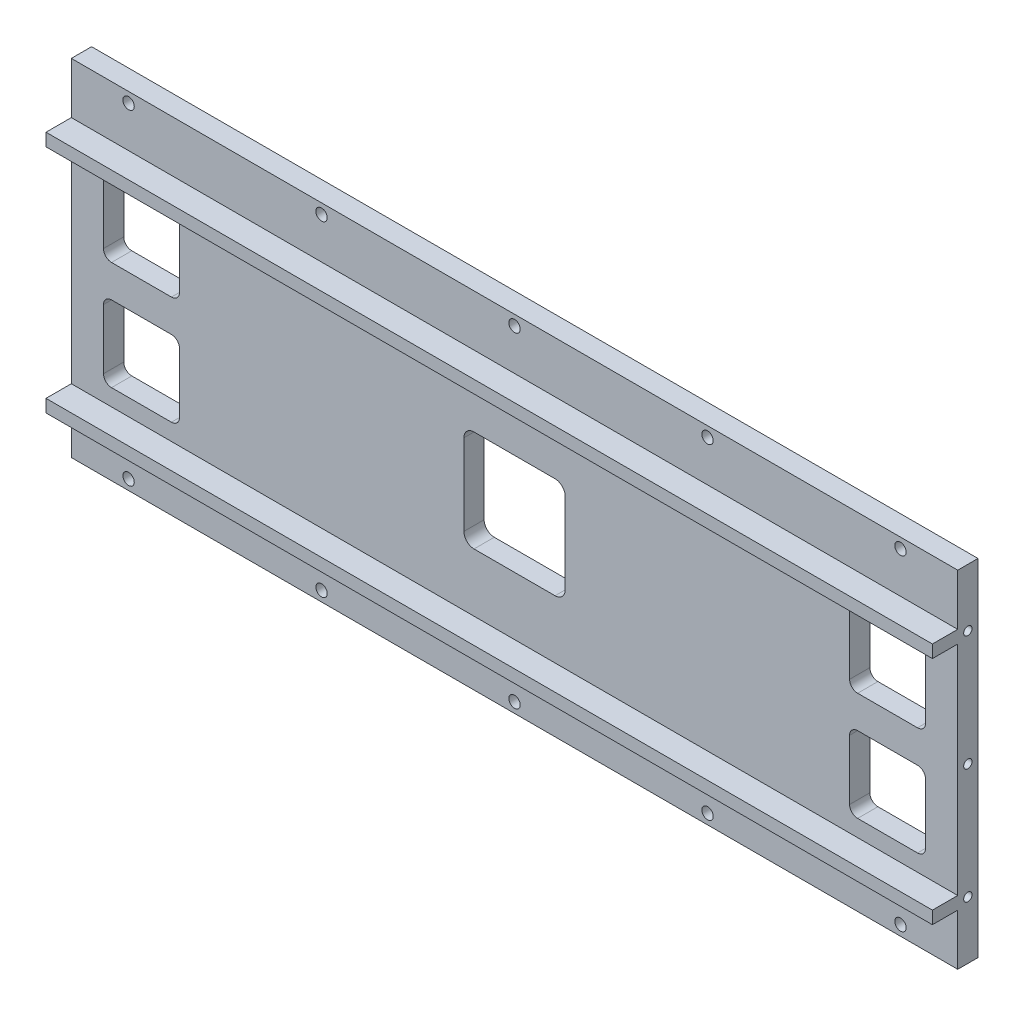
ISO-10303-21;
HEADER;
FILE_DESCRIPTION(('STEP AP214'),'2;1');
FILE_NAME('part.step','',(''),(''),'','','');
FILE_SCHEMA(('AUTOMOTIVE_DESIGN { 1 0 10303 214 1 1 1 1 }'));
ENDSEC;
DATA;
#1=APPLICATION_CONTEXT('core data for automotive mechanical design processes');
#2=APPLICATION_PROTOCOL_DEFINITION('international standard','automotive_design',2000,#1);
#3=PRODUCT_CONTEXT('',#1,'mechanical');
#4=PRODUCT('Part','Part','',(#3));
#5=PRODUCT_RELATED_PRODUCT_CATEGORY('part','',(#4));
#6=PRODUCT_DEFINITION_FORMATION('','',#4);
#7=PRODUCT_DEFINITION_CONTEXT('part definition',#1,'design');
#8=PRODUCT_DEFINITION('design','',#6,#7);
#9=PRODUCT_DEFINITION_SHAPE('','',#8);
#10=(LENGTH_UNIT() NAMED_UNIT(*) SI_UNIT(.MILLI.,.METRE.));
#11=(NAMED_UNIT(*) PLANE_ANGLE_UNIT() SI_UNIT($,.RADIAN.));
#12=(NAMED_UNIT(*) SI_UNIT($,.STERADIAN.) SOLID_ANGLE_UNIT());
#13=UNCERTAINTY_MEASURE_WITH_UNIT(LENGTH_MEASURE(1.E-05),#10,'distance_accuracy_value','');
#14=(GEOMETRIC_REPRESENTATION_CONTEXT(3) GLOBAL_UNCERTAINTY_ASSIGNED_CONTEXT((#13)) GLOBAL_UNIT_ASSIGNED_CONTEXT((#10,
#11,#12)) REPRESENTATION_CONTEXT('',''));
#15=CARTESIAN_POINT('',(0.,0.,0.));
#16=DIRECTION('',(0.,0.,1.));
#17=DIRECTION('',(1.,0.,0.));
#18=AXIS2_PLACEMENT_3D('',#15,#16,#17);
#19=CARTESIAN_POINT('',(-175.,68.25,8.));
#20=DIRECTION('',(1.,0.,0.));
#21=DIRECTION('',(0.,0.,-1.));
#22=AXIS2_PLACEMENT_3D('',#19,#20,#21);
#23=PLANE('',#22);
#24=DIRECTION('',(0.,0.,-1.));
#25=VECTOR('',#24,1.);
#26=CARTESIAN_POINT('',(-175.,48.,18.));
#27=LINE('',#26,#25);
#28=CARTESIAN_POINT('',(-175.,48.,18.));
#29=VERTEX_POINT('',#28);
#30=CARTESIAN_POINT('',(-175.,48.,8.));
#31=VERTEX_POINT('',#30);
#32=EDGE_CURVE('E811',#29,#31,#27,.T.);
#33=ORIENTED_EDGE('',*,*,#32,.T.);
#34=DIRECTION('',(0.,-1.,0.));
#35=VECTOR('',#34,1.);
#36=CARTESIAN_POINT('',(-175.,68.25,8.));
#37=LINE('',#36,#35);
#38=CARTESIAN_POINT('',(-175.,68.25,8.));
#39=VERTEX_POINT('',#38);
#40=EDGE_CURVE('E828',#39,#31,#37,.T.);
#41=ORIENTED_EDGE('',*,*,#40,.F.);
#42=DIRECTION('',(0.,0.,-1.));
#43=VECTOR('',#42,1.);
#44=CARTESIAN_POINT('',(-175.,68.25,8.));
#45=LINE('',#44,#43);
#46=CARTESIAN_POINT('',(-175.,68.25,0.));
#47=VERTEX_POINT('',#46);
#48=EDGE_CURVE('E840',#39,#47,#45,.T.);
#49=ORIENTED_EDGE('',*,*,#48,.T.);
#50=DIRECTION('',(0.,-1.,0.));
#51=VECTOR('',#50,1.);
#52=CARTESIAN_POINT('',(-175.,68.25,0.));
#53=LINE('',#52,#51);
#54=CARTESIAN_POINT('',(-175.,-68.25,0.));
#55=VERTEX_POINT('',#54);
#56=EDGE_CURVE('E827',#47,#55,#53,.T.);
#57=ORIENTED_EDGE('',*,*,#56,.T.);
#58=DIRECTION('',(0.,0.,-1.));
#59=VECTOR('',#58,1.);
#60=CARTESIAN_POINT('',(-175.,-68.25,8.));
#61=LINE('',#60,#59);
#62=CARTESIAN_POINT('',(-175.,-68.25,8.));
#63=VERTEX_POINT('',#62);
#64=EDGE_CURVE('E857',#63,#55,#61,.T.);
#65=ORIENTED_EDGE('',*,*,#64,.F.);
#66=CARTESIAN_POINT('',(-175.,-48.,8.));
#67=VERTEX_POINT('',#66);
#68=EDGE_CURVE('E832',#67,#63,#37,.T.);
#69=ORIENTED_EDGE('',*,*,#68,.F.);
#70=DIRECTION('',(0.,0.,-1.));
#71=VECTOR('',#70,1.);
#72=CARTESIAN_POINT('',(-175.,-48.,18.));
#73=LINE('',#72,#71);
#74=CARTESIAN_POINT('',(-175.,-48.,18.));
#75=VERTEX_POINT('',#74);
#76=EDGE_CURVE('E722',#75,#67,#73,.T.);
#77=ORIENTED_EDGE('',*,*,#76,.F.);
#78=DIRECTION('',(0.,1.,0.));
#79=VECTOR('',#78,1.);
#80=CARTESIAN_POINT('',(-175.,-48.,18.));
#81=LINE('',#80,#79);
#82=CARTESIAN_POINT('',(-175.,-43.,18.));
#83=VERTEX_POINT('',#82);
#84=EDGE_CURVE('E698',#75,#83,#81,.T.);
#85=ORIENTED_EDGE('',*,*,#84,.T.);
#86=DIRECTION('',(0.,0.,-1.));
#87=VECTOR('',#86,1.);
#88=CARTESIAN_POINT('',(-175.,-43.,18.));
#89=LINE('',#88,#87);
#90=CARTESIAN_POINT('',(-175.,-43.,8.));
#91=VERTEX_POINT('',#90);
#92=EDGE_CURVE('E711',#83,#91,#89,.T.);
#93=ORIENTED_EDGE('',*,*,#92,.T.);
#94=CARTESIAN_POINT('',(-175.,43.,8.));
#95=VERTEX_POINT('',#94);
#96=EDGE_CURVE('E831',#95,#91,#37,.T.);
#97=ORIENTED_EDGE('',*,*,#96,.F.);
#98=DIRECTION('',(0.,0.,-1.));
#99=VECTOR('',#98,1.);
#100=CARTESIAN_POINT('',(-175.,43.,18.));
#101=LINE('',#100,#99);
#102=CARTESIAN_POINT('',(-175.,43.,18.));
#103=VERTEX_POINT('',#102);
#104=EDGE_CURVE('E824',#103,#95,#101,.T.);
#105=ORIENTED_EDGE('',*,*,#104,.F.);
#106=DIRECTION('',(0.,-1.,0.));
#107=VECTOR('',#106,1.);
#108=CARTESIAN_POINT('',(-175.,48.,18.));
#109=LINE('',#108,#107);
#110=EDGE_CURVE('E801',#29,#103,#109,.T.);
#111=ORIENTED_EDGE('',*,*,#110,.F.);
#112=EDGE_LOOP('',(#33,#41,#49,#57,#65,#69,#77,#85,#93,#97,#105,#111));
#113=FACE_BOUND('',#112,.T.);
#114=CARTESIAN_POINT('',(-175.,45.5,4.));
#115=DIRECTION('',(-1.,0.,0.));
#116=DIRECTION('',(0.,0.,1.));
#117=AXIS2_PLACEMENT_3D('',#114,#115,#116);
#118=CIRCLE('',#117,1.64999999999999);
#119=CARTESIAN_POINT('',(-175.,45.5,5.64999999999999));
#120=VERTEX_POINT('',#119);
#121=EDGE_CURVE('E389',#120,#120,#118,.T.);
#122=ORIENTED_EDGE('',*,*,#121,.F.);
#123=EDGE_LOOP('',(#122));
#124=FACE_BOUND('',#123,.T.);
#125=CARTESIAN_POINT('',(-175.,-45.5,4.));
#126=DIRECTION('',(-1.,0.,0.));
#127=DIRECTION('',(0.,0.,1.));
#128=AXIS2_PLACEMENT_3D('',#125,#126,#127);
#129=CIRCLE('',#128,1.64999999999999);
#130=CARTESIAN_POINT('',(-175.,-45.5,5.64999999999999));
#131=VERTEX_POINT('',#130);
#132=EDGE_CURVE('E444',#131,#131,#129,.T.);
#133=ORIENTED_EDGE('',*,*,#132,.F.);
#134=EDGE_LOOP('',(#133));
#135=FACE_BOUND('',#134,.T.);
#136=CARTESIAN_POINT('',(-175.,0.,4.));
#137=DIRECTION('',(-1.,0.,0.));
#138=DIRECTION('',(0.,0.,1.));
#139=AXIS2_PLACEMENT_3D('',#136,#137,#138);
#140=CIRCLE('',#139,1.64999999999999);
#141=CARTESIAN_POINT('',(-175.,0.,5.64999999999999));
#142=VERTEX_POINT('',#141);
#143=EDGE_CURVE('E450',#142,#142,#140,.T.);
#144=ORIENTED_EDGE('',*,*,#143,.F.);
#145=EDGE_LOOP('',(#144));
#146=FACE_BOUND('',#145,.T.);
#147=ADVANCED_FACE('F36',(#113,#124,#135,#146),#23,.F.);
#148=CARTESIAN_POINT('',(0.,0.,0.));
#149=DIRECTION('',(0.,0.,1.));
#150=DIRECTION('',(1.,0.,0.));
#151=AXIS2_PLACEMENT_3D('',#148,#149,#150);
#152=PLANE('',#151);
#153=DIRECTION('',(1.,0.,0.));
#154=VECTOR('',#153,1.);
#155=CARTESIAN_POINT('',(-16.,20.,0.));
#156=LINE('',#155,#154);
#157=CARTESIAN_POINT('',(-16.,20.,0.));
#158=VERTEX_POINT('',#157);
#159=CARTESIAN_POINT('',(16.,20.,0.));
#160=VERTEX_POINT('',#159);
#161=EDGE_CURVE('E403',#158,#160,#156,.T.);
#162=ORIENTED_EDGE('',*,*,#161,.F.);
#163=CARTESIAN_POINT('',(-16.,16.,0.));
#164=DIRECTION('',(0.,0.,-1.));
#165=DIRECTION('',(-1.,0.,0.));
#166=AXIS2_PLACEMENT_3D('',#163,#164,#165);
#167=CIRCLE('',#166,4.);
#168=CARTESIAN_POINT('',(-20.,16.,0.));
#169=VERTEX_POINT('',#168);
#170=EDGE_CURVE('E51',#169,#158,#167,.T.);
#171=ORIENTED_EDGE('',*,*,#170,.F.);
#172=DIRECTION('',(0.,1.,0.));
#173=VECTOR('',#172,1.);
#174=CARTESIAN_POINT('',(-20.,-16.,0.));
#175=LINE('',#174,#173);
#176=CARTESIAN_POINT('',(-20.,-16.,0.));
#177=VERTEX_POINT('',#176);
#178=EDGE_CURVE('E395',#177,#169,#175,.T.);
#179=ORIENTED_EDGE('',*,*,#178,.F.);
#180=CARTESIAN_POINT('',(-16.,-16.,0.));
#181=DIRECTION('',(0.,0.,-1.));
#182=DIRECTION('',(-1.,0.,0.));
#183=AXIS2_PLACEMENT_3D('',#180,#181,#182);
#184=CIRCLE('',#183,4.);
#185=CARTESIAN_POINT('',(-16.,-20.,0.));
#186=VERTEX_POINT('',#185);
#187=EDGE_CURVE('E422',#186,#177,#184,.T.);
#188=ORIENTED_EDGE('',*,*,#187,.F.);
#189=DIRECTION('',(-1.,0.,0.));
#190=VECTOR('',#189,1.);
#191=CARTESIAN_POINT('',(-16.,-20.,0.));
#192=LINE('',#191,#190);
#193=CARTESIAN_POINT('',(16.,-20.,0.));
#194=VERTEX_POINT('',#193);
#195=EDGE_CURVE('E419',#194,#186,#192,.T.);
#196=ORIENTED_EDGE('',*,*,#195,.F.);
#197=CARTESIAN_POINT('',(16.,-16.,0.));
#198=DIRECTION('',(0.,0.,-1.));
#199=DIRECTION('',(1.,0.,0.));
#200=AXIS2_PLACEMENT_3D('',#197,#198,#199);
#201=CIRCLE('',#200,4.);
#202=CARTESIAN_POINT('',(20.,-16.,0.));
#203=VERTEX_POINT('',#202);
#204=EDGE_CURVE('E416',#203,#194,#201,.T.);
#205=ORIENTED_EDGE('',*,*,#204,.F.);
#206=DIRECTION('',(0.,-1.,0.));
#207=VECTOR('',#206,1.);
#208=CARTESIAN_POINT('',(20.,-16.,0.));
#209=LINE('',#208,#207);
#210=CARTESIAN_POINT('',(20.,16.,0.));
#211=VERTEX_POINT('',#210);
#212=EDGE_CURVE('E413',#211,#203,#209,.T.);
#213=ORIENTED_EDGE('',*,*,#212,.F.);
#214=CARTESIAN_POINT('',(16.,16.,0.));
#215=DIRECTION('',(0.,0.,-1.));
#216=DIRECTION('',(-1.,0.,0.));
#217=AXIS2_PLACEMENT_3D('',#214,#215,#216);
#218=CIRCLE('',#217,4.);
#219=EDGE_CURVE('E410',#160,#211,#218,.T.);
#220=ORIENTED_EDGE('',*,*,#219,.F.);
#221=EDGE_LOOP('',(#162,#171,#179,#188,#196,#205,#213,#220));
#222=FACE_BOUND('',#221,.T.);
#223=DIRECTION('',(0.,-1.,0.));
#224=VECTOR('',#223,1.);
#225=CARTESIAN_POINT('',(-132.3,-33.225,0.));
#226=LINE('',#225,#224);
#227=CARTESIAN_POINT('',(-132.3,-9.57500000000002,0.));
#228=VERTEX_POINT('',#227);
#229=CARTESIAN_POINT('',(-132.3,-33.225,0.));
#230=VERTEX_POINT('',#229);
#231=EDGE_CURVE('E470',#228,#230,#226,.T.);
#232=ORIENTED_EDGE('',*,*,#231,.F.);
#233=CARTESIAN_POINT('',(-135.475,-9.575,0.));
#234=DIRECTION('',(0.,0.,1.));
#235=DIRECTION('',(1.,0.,0.));
#236=AXIS2_PLACEMENT_3D('',#233,#234,#235);
#237=CIRCLE('',#236,3.17500000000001);
#238=CARTESIAN_POINT('',(-135.475,-6.4,0.));
#239=VERTEX_POINT('',#238);
#240=EDGE_CURVE('E473',#239,#228,#237,.F.);
#241=ORIENTED_EDGE('',*,*,#240,.F.);
#242=DIRECTION('',(1.,0.,0.));
#243=VECTOR('',#242,1.);
#244=CARTESIAN_POINT('',(-135.475,-6.4,0.));
#245=LINE('',#244,#243);
#246=CARTESIAN_POINT('',(-159.125,-6.4,0.));
#247=VERTEX_POINT('',#246);
#248=EDGE_CURVE('E502',#247,#239,#245,.T.);
#249=ORIENTED_EDGE('',*,*,#248,.F.);
#250=CARTESIAN_POINT('',(-159.125,-9.575,0.));
#251=DIRECTION('',(0.,0.,1.));
#252=DIRECTION('',(1.,0.,0.));
#253=AXIS2_PLACEMENT_3D('',#250,#251,#252);
#254=CIRCLE('',#253,3.17500000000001);
#255=CARTESIAN_POINT('',(-162.3,-9.57500000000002,0.));
#256=VERTEX_POINT('',#255);
#257=EDGE_CURVE('E456',#256,#247,#254,.F.);
#258=ORIENTED_EDGE('',*,*,#257,.F.);
#259=DIRECTION('',(0.,1.,0.));
#260=VECTOR('',#259,1.);
#261=CARTESIAN_POINT('',(-162.3,-33.225,0.));
#262=LINE('',#261,#260);
#263=CARTESIAN_POINT('',(-162.3,-33.225,0.));
#264=VERTEX_POINT('',#263);
#265=EDGE_CURVE('E458',#264,#256,#262,.T.);
#266=ORIENTED_EDGE('',*,*,#265,.F.);
#267=CARTESIAN_POINT('',(-159.125,-33.225,0.));
#268=DIRECTION('',(0.,0.,1.));
#269=DIRECTION('',(1.,0.,0.));
#270=AXIS2_PLACEMENT_3D('',#267,#268,#269);
#271=CIRCLE('',#270,3.175);
#272=CARTESIAN_POINT('',(-159.125,-36.4,0.));
#273=VERTEX_POINT('',#272);
#274=EDGE_CURVE('E461',#273,#264,#271,.F.);
#275=ORIENTED_EDGE('',*,*,#274,.F.);
#276=DIRECTION('',(-1.,0.,0.));
#277=VECTOR('',#276,1.);
#278=CARTESIAN_POINT('',(-135.475,-36.4,0.));
#279=LINE('',#278,#277);
#280=CARTESIAN_POINT('',(-135.475,-36.4,0.));
#281=VERTEX_POINT('',#280);
#282=EDGE_CURVE('E464',#281,#273,#279,.T.);
#283=ORIENTED_EDGE('',*,*,#282,.F.);
#284=CARTESIAN_POINT('',(-135.475,-33.225,0.));
#285=DIRECTION('',(0.,0.,1.));
#286=DIRECTION('',(1.,0.,0.));
#287=AXIS2_PLACEMENT_3D('',#284,#285,#286);
#288=CIRCLE('',#287,3.175);
#289=EDGE_CURVE('E467',#230,#281,#288,.F.);
#290=ORIENTED_EDGE('',*,*,#289,.F.);
#291=EDGE_LOOP('',(#232,#241,#249,#258,#266,#275,#283,#290));
#292=FACE_BOUND('',#291,.T.);
#293=CARTESIAN_POINT('',(135.475,-9.575,0.));
#294=DIRECTION('',(0.,0.,1.));
#295=DIRECTION('',(1.,0.,0.));
#296=AXIS2_PLACEMENT_3D('',#293,#294,#295);
#297=CIRCLE('',#296,3.17500000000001);
#298=CARTESIAN_POINT('',(135.475,-6.4,0.));
#299=VERTEX_POINT('',#298);
#300=CARTESIAN_POINT('',(132.3,-9.57500000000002,0.));
#301=VERTEX_POINT('',#300);
#302=EDGE_CURVE('E620',#299,#301,#297,.T.);
#303=ORIENTED_EDGE('',*,*,#302,.T.);
#304=DIRECTION('',(0.,-1.,0.));
#305=VECTOR('',#304,1.);
#306=CARTESIAN_POINT('',(132.3,-33.225,0.));
#307=LINE('',#306,#305);
#308=CARTESIAN_POINT('',(132.3,-33.225,0.));
#309=VERTEX_POINT('',#308);
#310=EDGE_CURVE('E650',#301,#309,#307,.T.);
#311=ORIENTED_EDGE('',*,*,#310,.T.);
#312=CARTESIAN_POINT('',(135.475,-33.225,0.));
#313=DIRECTION('',(0.,0.,1.));
#314=DIRECTION('',(1.,0.,0.));
#315=AXIS2_PLACEMENT_3D('',#312,#313,#314);
#316=CIRCLE('',#315,3.175);
#317=CARTESIAN_POINT('',(135.475,-36.4,0.));
#318=VERTEX_POINT('',#317);
#319=EDGE_CURVE('E602',#309,#318,#316,.T.);
#320=ORIENTED_EDGE('',*,*,#319,.T.);
#321=DIRECTION('',(1.,0.,0.));
#322=VECTOR('',#321,1.);
#323=CARTESIAN_POINT('',(135.475,-36.4,0.));
#324=LINE('',#323,#322);
#325=CARTESIAN_POINT('',(159.125,-36.4,0.));
#326=VERTEX_POINT('',#325);
#327=EDGE_CURVE('E605',#318,#326,#324,.T.);
#328=ORIENTED_EDGE('',*,*,#327,.T.);
#329=CARTESIAN_POINT('',(159.125,-33.225,0.));
#330=DIRECTION('',(0.,0.,1.));
#331=DIRECTION('',(1.,0.,0.));
#332=AXIS2_PLACEMENT_3D('',#329,#330,#331);
#333=CIRCLE('',#332,3.175);
#334=CARTESIAN_POINT('',(162.3,-33.225,0.));
#335=VERTEX_POINT('',#334);
#336=EDGE_CURVE('E608',#326,#335,#333,.T.);
#337=ORIENTED_EDGE('',*,*,#336,.T.);
#338=DIRECTION('',(0.,1.,0.));
#339=VECTOR('',#338,1.);
#340=CARTESIAN_POINT('',(162.3,-33.225,0.));
#341=LINE('',#340,#339);
#342=CARTESIAN_POINT('',(162.3,-9.57500000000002,0.));
#343=VERTEX_POINT('',#342);
#344=EDGE_CURVE('E611',#335,#343,#341,.T.);
#345=ORIENTED_EDGE('',*,*,#344,.T.);
#346=CARTESIAN_POINT('',(159.125,-9.575,0.));
#347=DIRECTION('',(0.,0.,1.));
#348=DIRECTION('',(1.,0.,0.));
#349=AXIS2_PLACEMENT_3D('',#346,#347,#348);
#350=CIRCLE('',#349,3.17500000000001);
#351=CARTESIAN_POINT('',(159.125,-6.39999999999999,0.));
#352=VERTEX_POINT('',#351);
#353=EDGE_CURVE('E614',#343,#352,#350,.T.);
#354=ORIENTED_EDGE('',*,*,#353,.T.);
#355=DIRECTION('',(-1.,0.,0.));
#356=VECTOR('',#355,1.);
#357=CARTESIAN_POINT('',(135.475,-6.4,0.));
#358=LINE('',#357,#356);
#359=EDGE_CURVE('E617',#352,#299,#358,.T.);
#360=ORIENTED_EDGE('',*,*,#359,.T.);
#361=EDGE_LOOP('',(#303,#311,#320,#328,#337,#345,#354,#360));
#362=FACE_BOUND('',#361,.T.);
#363=DIRECTION('',(0.,1.,0.));
#364=VECTOR('',#363,1.);
#365=CARTESIAN_POINT('',(132.3,33.225,0.));
#366=LINE('',#365,#364);
#367=CARTESIAN_POINT('',(132.3,9.57500000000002,0.));
#368=VERTEX_POINT('',#367);
#369=CARTESIAN_POINT('',(132.3,33.225,0.));
#370=VERTEX_POINT('',#369);
#371=EDGE_CURVE('E739',#368,#370,#366,.T.);
#372=ORIENTED_EDGE('',*,*,#371,.F.);
#373=CARTESIAN_POINT('',(135.475,9.575,0.));
#374=DIRECTION('',(0.,0.,1.));
#375=DIRECTION('',(1.,0.,0.));
#376=AXIS2_PLACEMENT_3D('',#373,#374,#375);
#377=CIRCLE('',#376,3.17500000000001);
#378=CARTESIAN_POINT('',(135.475,6.4,0.));
#379=VERTEX_POINT('',#378);
#380=EDGE_CURVE('E742',#379,#368,#377,.F.);
#381=ORIENTED_EDGE('',*,*,#380,.F.);
#382=DIRECTION('',(-1.,0.,0.));
#383=VECTOR('',#382,1.);
#384=CARTESIAN_POINT('',(135.475,6.4,0.));
#385=LINE('',#384,#383);
#386=CARTESIAN_POINT('',(159.125,6.4,0.));
#387=VERTEX_POINT('',#386);
#388=EDGE_CURVE('E771',#387,#379,#385,.T.);
#389=ORIENTED_EDGE('',*,*,#388,.F.);
#390=CARTESIAN_POINT('',(159.125,9.575,0.));
#391=DIRECTION('',(0.,0.,1.));
#392=DIRECTION('',(1.,0.,0.));
#393=AXIS2_PLACEMENT_3D('',#390,#391,#392);
#394=CIRCLE('',#393,3.17500000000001);
#395=CARTESIAN_POINT('',(162.3,9.57500000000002,0.));
#396=VERTEX_POINT('',#395);
#397=EDGE_CURVE('E725',#396,#387,#394,.F.);
#398=ORIENTED_EDGE('',*,*,#397,.F.);
#399=DIRECTION('',(0.,-1.,0.));
#400=VECTOR('',#399,1.);
#401=CARTESIAN_POINT('',(162.3,33.225,0.));
#402=LINE('',#401,#400);
#403=CARTESIAN_POINT('',(162.3,33.225,0.));
#404=VERTEX_POINT('',#403);
#405=EDGE_CURVE('E727',#404,#396,#402,.T.);
#406=ORIENTED_EDGE('',*,*,#405,.F.);
#407=CARTESIAN_POINT('',(159.125,33.225,0.));
#408=DIRECTION('',(0.,0.,1.));
#409=DIRECTION('',(1.,0.,0.));
#410=AXIS2_PLACEMENT_3D('',#407,#408,#409);
#411=CIRCLE('',#410,3.175);
#412=CARTESIAN_POINT('',(159.125,36.4,0.));
#413=VERTEX_POINT('',#412);
#414=EDGE_CURVE('E730',#413,#404,#411,.F.);
#415=ORIENTED_EDGE('',*,*,#414,.F.);
#416=DIRECTION('',(1.,0.,0.));
#417=VECTOR('',#416,1.);
#418=CARTESIAN_POINT('',(135.475,36.4,0.));
#419=LINE('',#418,#417);
#420=CARTESIAN_POINT('',(135.475,36.4,0.));
#421=VERTEX_POINT('',#420);
#422=EDGE_CURVE('E733',#421,#413,#419,.T.);
#423=ORIENTED_EDGE('',*,*,#422,.F.);
#424=CARTESIAN_POINT('',(135.475,33.225,0.));
#425=DIRECTION('',(0.,0.,1.));
#426=DIRECTION('',(1.,0.,0.));
#427=AXIS2_PLACEMENT_3D('',#424,#425,#426);
#428=CIRCLE('',#427,3.175);
#429=EDGE_CURVE('E736',#370,#421,#428,.F.);
#430=ORIENTED_EDGE('',*,*,#429,.F.);
#431=EDGE_LOOP('',(#372,#381,#389,#398,#406,#415,#423,#430));
#432=FACE_BOUND('',#431,.T.);
#433=CARTESIAN_POINT('',(76.2,64.25,0.));
#434=DIRECTION('',(0.,0.,-1.));
#435=DIRECTION('',(-1.,0.,0.));
#436=AXIS2_PLACEMENT_3D('',#433,#434,#435);
#437=CIRCLE('',#436,2.25);
#438=CARTESIAN_POINT('',(73.95,64.25,0.));
#439=VERTEX_POINT('',#438);
#440=EDGE_CURVE('E791',#439,#439,#437,.T.);
#441=ORIENTED_EDGE('',*,*,#440,.F.);
#442=EDGE_LOOP('',(#441));
#443=FACE_BOUND('',#442,.T.);
#444=CARTESIAN_POINT('',(152.4,64.25,0.));
#445=DIRECTION('',(0.,0.,-1.));
#446=DIRECTION('',(-1.,0.,0.));
#447=AXIS2_PLACEMENT_3D('',#444,#445,#446);
#448=CIRCLE('',#447,2.25);
#449=CARTESIAN_POINT('',(150.15,64.25,0.));
#450=VERTEX_POINT('',#449);
#451=EDGE_CURVE('E794',#450,#450,#448,.T.);
#452=ORIENTED_EDGE('',*,*,#451,.F.);
#453=EDGE_LOOP('',(#452));
#454=FACE_BOUND('',#453,.T.);
#455=ORIENTED_EDGE('',*,*,#56,.F.);
#456=DIRECTION('',(-1.,0.,0.));
#457=VECTOR('',#456,1.);
#458=CARTESIAN_POINT('',(-175.,68.25,0.));
#459=LINE('',#458,#457);
#460=CARTESIAN_POINT('',(175.,68.25,0.));
#461=VERTEX_POINT('',#460);
#462=EDGE_CURVE('E847',#461,#47,#459,.T.);
#463=ORIENTED_EDGE('',*,*,#462,.F.);
#464=DIRECTION('',(0.,1.,0.));
#465=VECTOR('',#464,1.);
#466=CARTESIAN_POINT('',(175.,68.25,0.));
#467=LINE('',#466,#465);
#468=CARTESIAN_POINT('',(175.,-68.25,0.));
#469=VERTEX_POINT('',#468);
#470=EDGE_CURVE('E845',#469,#461,#467,.T.);
#471=ORIENTED_EDGE('',*,*,#470,.F.);
#472=DIRECTION('',(1.,0.,0.));
#473=VECTOR('',#472,1.);
#474=CARTESIAN_POINT('',(-175.,-68.25,0.));
#475=LINE('',#474,#473);
#476=EDGE_CURVE('E843',#55,#469,#475,.T.);
#477=ORIENTED_EDGE('',*,*,#476,.F.);
#478=EDGE_LOOP('',(#455,#463,#471,#477));
#479=FACE_BOUND('',#478,.T.);
#480=CARTESIAN_POINT('',(0.,64.25,0.));
#481=DIRECTION('',(0.,0.,-1.));
#482=DIRECTION('',(-1.,0.,0.));
#483=AXIS2_PLACEMENT_3D('',#480,#481,#482);
#484=CIRCLE('',#483,2.25);
#485=CARTESIAN_POINT('',(-2.25000000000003,64.25,0.));
#486=VERTEX_POINT('',#485);
#487=EDGE_CURVE('E863',#486,#486,#484,.T.);
#488=ORIENTED_EDGE('',*,*,#487,.F.);
#489=EDGE_LOOP('',(#488));
#490=FACE_BOUND('',#489,.T.);
#491=CARTESIAN_POINT('',(-76.2000000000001,64.25,0.));
#492=DIRECTION('',(0.,0.,-1.));
#493=DIRECTION('',(-1.,0.,0.));
#494=AXIS2_PLACEMENT_3D('',#491,#492,#493);
#495=CIRCLE('',#494,2.25);
#496=CARTESIAN_POINT('',(-78.4500000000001,64.25,0.));
#497=VERTEX_POINT('',#496);
#498=EDGE_CURVE('E869',#497,#497,#495,.T.);
#499=ORIENTED_EDGE('',*,*,#498,.F.);
#500=EDGE_LOOP('',(#499));
#501=FACE_BOUND('',#500,.T.);
#502=CARTESIAN_POINT('',(-152.4,64.25,0.));
#503=DIRECTION('',(0.,0.,-1.));
#504=DIRECTION('',(-1.,0.,0.));
#505=AXIS2_PLACEMENT_3D('',#502,#503,#504);
#506=CIRCLE('',#505,2.25);
#507=CARTESIAN_POINT('',(-154.65,64.25,0.));
#508=VERTEX_POINT('',#507);
#509=EDGE_CURVE('E11',#508,#508,#506,.T.);
#510=ORIENTED_EDGE('',*,*,#509,.F.);
#511=EDGE_LOOP('',(#510));
#512=FACE_BOUND('',#511,.T.);
#513=CARTESIAN_POINT('',(152.4,-64.25,0.));
#514=DIRECTION('',(0.,0.,-1.));
#515=DIRECTION('',(-1.,0.,0.));
#516=AXIS2_PLACEMENT_3D('',#513,#514,#515);
#517=CIRCLE('',#516,2.25);
#518=CARTESIAN_POINT('',(150.15,-64.25,0.));
#519=VERTEX_POINT('',#518);
#520=EDGE_CURVE('E691',#519,#519,#517,.T.);
#521=ORIENTED_EDGE('',*,*,#520,.F.);
#522=EDGE_LOOP('',(#521));
#523=FACE_BOUND('',#522,.T.);
#524=CARTESIAN_POINT('',(76.2,-64.25,0.));
#525=DIRECTION('',(0.,0.,-1.));
#526=DIRECTION('',(-1.,0.,0.));
#527=AXIS2_PLACEMENT_3D('',#524,#525,#526);
#528=CIRCLE('',#527,2.25);
#529=CARTESIAN_POINT('',(73.95,-64.25,0.));
#530=VERTEX_POINT('',#529);
#531=EDGE_CURVE('E685',#530,#530,#528,.T.);
#532=ORIENTED_EDGE('',*,*,#531,.F.);
#533=EDGE_LOOP('',(#532));
#534=FACE_BOUND('',#533,.T.);
#535=CARTESIAN_POINT('',(0.,-64.25,0.));
#536=DIRECTION('',(0.,0.,-1.));
#537=DIRECTION('',(-1.,0.,0.));
#538=AXIS2_PLACEMENT_3D('',#535,#536,#537);
#539=CIRCLE('',#538,2.25);
#540=CARTESIAN_POINT('',(-2.25000000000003,-64.25,0.));
#541=VERTEX_POINT('',#540);
#542=EDGE_CURVE('E679',#541,#541,#539,.T.);
#543=ORIENTED_EDGE('',*,*,#542,.F.);
#544=EDGE_LOOP('',(#543));
#545=FACE_BOUND('',#544,.T.);
#546=CARTESIAN_POINT('',(-76.2,-64.25,0.));
#547=DIRECTION('',(0.,0.,-1.));
#548=DIRECTION('',(-1.,0.,0.));
#549=AXIS2_PLACEMENT_3D('',#546,#547,#548);
#550=CIRCLE('',#549,2.25);
#551=CARTESIAN_POINT('',(-78.45,-64.25,0.));
#552=VERTEX_POINT('',#551);
#553=EDGE_CURVE('E673',#552,#552,#550,.T.);
#554=ORIENTED_EDGE('',*,*,#553,.F.);
#555=EDGE_LOOP('',(#554));
#556=FACE_BOUND('',#555,.T.);
#557=CARTESIAN_POINT('',(-152.4,-64.25,0.));
#558=DIRECTION('',(0.,0.,-1.));
#559=DIRECTION('',(-1.,0.,0.));
#560=AXIS2_PLACEMENT_3D('',#557,#558,#559);
#561=CIRCLE('',#560,2.25);
#562=CARTESIAN_POINT('',(-154.65,-64.25,0.));
#563=VERTEX_POINT('',#562);
#564=EDGE_CURVE('E667',#563,#563,#561,.T.);
#565=ORIENTED_EDGE('',*,*,#564,.F.);
#566=EDGE_LOOP('',(#565));
#567=FACE_BOUND('',#566,.T.);
#568=CARTESIAN_POINT('',(-135.475,9.575,0.));
#569=DIRECTION('',(0.,0.,1.));
#570=DIRECTION('',(1.,0.,0.));
#571=AXIS2_PLACEMENT_3D('',#568,#569,#570);
#572=CIRCLE('',#571,3.17500000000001);
#573=CARTESIAN_POINT('',(-135.475,6.4,0.));
#574=VERTEX_POINT('',#573);
#575=CARTESIAN_POINT('',(-132.3,9.57500000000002,0.));
#576=VERTEX_POINT('',#575);
#577=EDGE_CURVE('E537',#574,#576,#572,.T.);
#578=ORIENTED_EDGE('',*,*,#577,.T.);
#579=DIRECTION('',(0.,1.,0.));
#580=VECTOR('',#579,1.);
#581=CARTESIAN_POINT('',(-132.3,33.225,0.));
#582=LINE('',#581,#580);
#583=CARTESIAN_POINT('',(-132.3,33.225,0.));
#584=VERTEX_POINT('',#583);
#585=EDGE_CURVE('E567',#576,#584,#582,.T.);
#586=ORIENTED_EDGE('',*,*,#585,.T.);
#587=CARTESIAN_POINT('',(-135.475,33.225,0.));
#588=DIRECTION('',(0.,0.,1.));
#589=DIRECTION('',(1.,0.,0.));
#590=AXIS2_PLACEMENT_3D('',#587,#588,#589);
#591=CIRCLE('',#590,3.175);
#592=CARTESIAN_POINT('',(-135.475,36.4,0.));
#593=VERTEX_POINT('',#592);
#594=EDGE_CURVE('E519',#584,#593,#591,.T.);
#595=ORIENTED_EDGE('',*,*,#594,.T.);
#596=DIRECTION('',(-1.,0.,0.));
#597=VECTOR('',#596,1.);
#598=CARTESIAN_POINT('',(-135.475,36.4,0.));
#599=LINE('',#598,#597);
#600=CARTESIAN_POINT('',(-159.125,36.4,0.));
#601=VERTEX_POINT('',#600);
#602=EDGE_CURVE('E522',#593,#601,#599,.T.);
#603=ORIENTED_EDGE('',*,*,#602,.T.);
#604=CARTESIAN_POINT('',(-159.125,33.225,0.));
#605=DIRECTION('',(0.,0.,1.));
#606=DIRECTION('',(1.,0.,0.));
#607=AXIS2_PLACEMENT_3D('',#604,#605,#606);
#608=CIRCLE('',#607,3.175);
#609=CARTESIAN_POINT('',(-162.3,33.225,0.));
#610=VERTEX_POINT('',#609);
#611=EDGE_CURVE('E525',#601,#610,#608,.T.);
#612=ORIENTED_EDGE('',*,*,#611,.T.);
#613=DIRECTION('',(0.,-1.,0.));
#614=VECTOR('',#613,1.);
#615=CARTESIAN_POINT('',(-162.3,33.225,0.));
#616=LINE('',#615,#614);
#617=CARTESIAN_POINT('',(-162.3,9.57500000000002,0.));
#618=VERTEX_POINT('',#617);
#619=EDGE_CURVE('E528',#610,#618,#616,.T.);
#620=ORIENTED_EDGE('',*,*,#619,.T.);
#621=CARTESIAN_POINT('',(-159.125,9.575,0.));
#622=DIRECTION('',(0.,0.,1.));
#623=DIRECTION('',(1.,0.,0.));
#624=AXIS2_PLACEMENT_3D('',#621,#622,#623);
#625=CIRCLE('',#624,3.17500000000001);
#626=CARTESIAN_POINT('',(-159.125,6.39999999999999,0.));
#627=VERTEX_POINT('',#626);
#628=EDGE_CURVE('E531',#618,#627,#625,.T.);
#629=ORIENTED_EDGE('',*,*,#628,.T.);
#630=DIRECTION('',(1.,0.,0.));
#631=VECTOR('',#630,1.);
#632=CARTESIAN_POINT('',(-135.475,6.4,0.));
#633=LINE('',#632,#631);
#634=EDGE_CURVE('E534',#627,#574,#633,.T.);
#635=ORIENTED_EDGE('',*,*,#634,.T.);
#636=EDGE_LOOP('',(#578,#586,#595,#603,#612,#620,#629,#635));
#637=FACE_BOUND('',#636,.T.);
#638=ADVANCED_FACE('F898',(#222,#292,#362,#432,#443,#454,#479,#490,#501,#512,#523,#534,#545,
#556,#567,#637),#152,.F.);
#639=CARTESIAN_POINT('',(0.,0.,8.));
#640=DIRECTION('',(0.,0.,1.));
#641=DIRECTION('',(1.,0.,0.));
#642=AXIS2_PLACEMENT_3D('',#639,#640,#641);
#643=PLANE('',#642);
#644=CARTESIAN_POINT('',(-16.,16.,8.));
#645=DIRECTION('',(0.,0.,1.));
#646=DIRECTION('',(1.,0.,0.));
#647=AXIS2_PLACEMENT_3D('',#644,#645,#646);
#648=CIRCLE('',#647,4.);
#649=CARTESIAN_POINT('',(-20.,16.,8.));
#650=VERTEX_POINT('',#649);
#651=CARTESIAN_POINT('',(-16.,20.,8.));
#652=VERTEX_POINT('',#651);
#653=EDGE_CURVE('E393',#650,#652,#648,.F.);
#654=ORIENTED_EDGE('',*,*,#653,.T.);
#655=DIRECTION('',(1.,0.,0.));
#656=VECTOR('',#655,1.);
#657=CARTESIAN_POINT('',(-16.,20.,8.));
#658=LINE('',#657,#656);
#659=CARTESIAN_POINT('',(16.,20.,8.));
#660=VERTEX_POINT('',#659);
#661=EDGE_CURVE('E382',#652,#660,#658,.T.);
#662=ORIENTED_EDGE('',*,*,#661,.T.);
#663=CARTESIAN_POINT('',(16.,16.,8.));
#664=DIRECTION('',(0.,0.,1.));
#665=DIRECTION('',(1.,0.,0.));
#666=AXIS2_PLACEMENT_3D('',#663,#664,#665);
#667=CIRCLE('',#666,4.);
#668=CARTESIAN_POINT('',(20.,16.,8.));
#669=VERTEX_POINT('',#668);
#670=EDGE_CURVE('E1802',#660,#669,#667,.F.);
#671=ORIENTED_EDGE('',*,*,#670,.T.);
#672=DIRECTION('',(0.,-1.,0.));
#673=VECTOR('',#672,1.);
#674=CARTESIAN_POINT('',(20.,-16.,8.));
#675=LINE('',#674,#673);
#676=CARTESIAN_POINT('',(20.,-16.,8.));
#677=VERTEX_POINT('',#676);
#678=EDGE_CURVE('E1807',#669,#677,#675,.T.);
#679=ORIENTED_EDGE('',*,*,#678,.T.);
#680=CARTESIAN_POINT('',(16.,-16.,8.));
#681=DIRECTION('',(0.,0.,1.));
#682=DIRECTION('',(1.,0.,0.));
#683=AXIS2_PLACEMENT_3D('',#680,#681,#682);
#684=CIRCLE('',#683,4.);
#685=CARTESIAN_POINT('',(16.,-20.,8.));
#686=VERTEX_POINT('',#685);
#687=EDGE_CURVE('E1810',#677,#686,#684,.F.);
#688=ORIENTED_EDGE('',*,*,#687,.T.);
#689=DIRECTION('',(-1.,0.,0.));
#690=VECTOR('',#689,1.);
#691=CARTESIAN_POINT('',(-16.,-20.,8.));
#692=LINE('',#691,#690);
#693=CARTESIAN_POINT('',(-16.,-20.,8.));
#694=VERTEX_POINT('',#693);
#695=EDGE_CURVE('E1814',#686,#694,#692,.T.);
#696=ORIENTED_EDGE('',*,*,#695,.T.);
#697=CARTESIAN_POINT('',(-16.,-16.,8.));
#698=DIRECTION('',(0.,0.,1.));
#699=DIRECTION('',(1.,0.,0.));
#700=AXIS2_PLACEMENT_3D('',#697,#698,#699);
#701=CIRCLE('',#700,4.);
#702=CARTESIAN_POINT('',(-20.,-16.,8.));
#703=VERTEX_POINT('',#702);
#704=EDGE_CURVE('E405',#694,#703,#701,.F.);
#705=ORIENTED_EDGE('',*,*,#704,.T.);
#706=DIRECTION('',(0.,1.,0.));
#707=VECTOR('',#706,1.);
#708=CARTESIAN_POINT('',(-20.,-16.,8.));
#709=LINE('',#708,#707);
#710=EDGE_CURVE('E401',#703,#650,#709,.T.);
#711=ORIENTED_EDGE('',*,*,#710,.T.);
#712=EDGE_LOOP('',(#654,#662,#671,#679,#688,#696,#705,#711));
#713=FACE_BOUND('',#712,.T.);
#714=CARTESIAN_POINT('',(-135.475,-9.575,8.));
#715=DIRECTION('',(0.,0.,1.));
#716=DIRECTION('',(-1.,0.,0.));
#717=AXIS2_PLACEMENT_3D('',#714,#715,#716);
#718=CIRCLE('',#717,3.17500000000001);
#719=CARTESIAN_POINT('',(-132.3,-9.57500000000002,8.));
#720=VERTEX_POINT('',#719);
#721=CARTESIAN_POINT('',(-135.475,-6.4,8.));
#722=VERTEX_POINT('',#721);
#723=EDGE_CURVE('E476',#720,#722,#718,.T.);
#724=ORIENTED_EDGE('',*,*,#723,.F.);
#725=DIRECTION('',(0.,1.,0.));
#726=VECTOR('',#725,1.);
#727=CARTESIAN_POINT('',(-132.3,-33.225,8.));
#728=LINE('',#727,#726);
#729=CARTESIAN_POINT('',(-132.3,-33.225,8.));
#730=VERTEX_POINT('',#729);
#731=EDGE_CURVE('E496',#730,#720,#728,.T.);
#732=ORIENTED_EDGE('',*,*,#731,.F.);
#733=CARTESIAN_POINT('',(-135.475,-33.225,8.));
#734=DIRECTION('',(0.,0.,1.));
#735=DIRECTION('',(-1.,0.,0.));
#736=AXIS2_PLACEMENT_3D('',#733,#734,#735);
#737=CIRCLE('',#736,3.175);
#738=CARTESIAN_POINT('',(-135.475,-36.4,8.));
#739=VERTEX_POINT('',#738);
#740=EDGE_CURVE('E493',#739,#730,#737,.T.);
#741=ORIENTED_EDGE('',*,*,#740,.F.);
#742=DIRECTION('',(1.,0.,0.));
#743=VECTOR('',#742,1.);
#744=CARTESIAN_POINT('',(-135.475,-36.4,8.));
#745=LINE('',#744,#743);
#746=CARTESIAN_POINT('',(-159.125,-36.4,8.));
#747=VERTEX_POINT('',#746);
#748=EDGE_CURVE('E490',#747,#739,#745,.T.);
#749=ORIENTED_EDGE('',*,*,#748,.F.);
#750=CARTESIAN_POINT('',(-159.125,-33.225,8.));
#751=DIRECTION('',(0.,0.,1.));
#752=DIRECTION('',(1.,0.,0.));
#753=AXIS2_PLACEMENT_3D('',#750,#751,#752);
#754=CIRCLE('',#753,3.175);
#755=CARTESIAN_POINT('',(-162.3,-33.225,8.));
#756=VERTEX_POINT('',#755);
#757=EDGE_CURVE('E487',#756,#747,#754,.T.);
#758=ORIENTED_EDGE('',*,*,#757,.F.);
#759=DIRECTION('',(0.,-1.,0.));
#760=VECTOR('',#759,1.);
#761=CARTESIAN_POINT('',(-162.3,-33.225,8.));
#762=LINE('',#761,#760);
#763=CARTESIAN_POINT('',(-162.3,-9.57500000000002,8.));
#764=VERTEX_POINT('',#763);
#765=EDGE_CURVE('E484',#764,#756,#762,.T.);
#766=ORIENTED_EDGE('',*,*,#765,.F.);
#767=CARTESIAN_POINT('',(-159.125,-9.575,8.));
#768=DIRECTION('',(0.,0.,1.));
#769=DIRECTION('',(-1.,0.,0.));
#770=AXIS2_PLACEMENT_3D('',#767,#768,#769);
#771=CIRCLE('',#770,3.17500000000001);
#772=CARTESIAN_POINT('',(-159.125,-6.39999999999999,8.));
#773=VERTEX_POINT('',#772);
#774=EDGE_CURVE('E481',#773,#764,#771,.T.);
#775=ORIENTED_EDGE('',*,*,#774,.F.);
#776=DIRECTION('',(-1.,0.,0.));
#777=VECTOR('',#776,1.);
#778=CARTESIAN_POINT('',(-135.475,-6.4,8.));
#779=LINE('',#778,#777);
#780=EDGE_CURVE('E478',#722,#773,#779,.T.);
#781=ORIENTED_EDGE('',*,*,#780,.F.);
#782=EDGE_LOOP('',(#724,#732,#741,#749,#758,#766,#775,#781));
#783=FACE_BOUND('',#782,.T.);
#784=DIRECTION('',(1.,0.,0.));
#785=VECTOR('',#784,1.);
#786=CARTESIAN_POINT('',(-175.,-43.,8.));
#787=LINE('',#786,#785);
#788=CARTESIAN_POINT('',(175.,-43.,8.));
#789=VERTEX_POINT('',#788);
#790=EDGE_CURVE('E702',#91,#789,#787,.T.);
#791=ORIENTED_EDGE('',*,*,#790,.T.);
#792=DIRECTION('',(0.,1.,0.));
#793=VECTOR('',#792,1.);
#794=CARTESIAN_POINT('',(175.,68.25,8.));
#795=LINE('',#794,#793);
#796=CARTESIAN_POINT('',(175.,43.,8.));
#797=VERTEX_POINT('',#796);
#798=EDGE_CURVE('E838',#789,#797,#795,.T.);
#799=ORIENTED_EDGE('',*,*,#798,.T.);
#800=DIRECTION('',(1.,0.,0.));
#801=VECTOR('',#800,1.);
#802=CARTESIAN_POINT('',(-175.,43.,8.));
#803=LINE('',#802,#801);
#804=EDGE_CURVE('E800',#95,#797,#803,.T.);
#805=ORIENTED_EDGE('',*,*,#804,.F.);
#806=ORIENTED_EDGE('',*,*,#96,.T.);
#807=EDGE_LOOP('',(#791,#799,#805,#806));
#808=FACE_BOUND('',#807,.T.);
#809=CARTESIAN_POINT('',(135.475,9.575,8.));
#810=DIRECTION('',(0.,0.,1.));
#811=DIRECTION('',(1.,0.,0.));
#812=AXIS2_PLACEMENT_3D('',#809,#810,#811);
#813=CIRCLE('',#812,3.17500000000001);
#814=CARTESIAN_POINT('',(132.3,9.57500000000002,8.));
#815=VERTEX_POINT('',#814);
#816=CARTESIAN_POINT('',(135.475,6.4,8.));
#817=VERTEX_POINT('',#816);
#818=EDGE_CURVE('E745',#815,#817,#813,.T.);
#819=ORIENTED_EDGE('',*,*,#818,.F.);
#820=DIRECTION('',(0.,-1.,0.));
#821=VECTOR('',#820,1.);
#822=CARTESIAN_POINT('',(132.3,33.225,8.));
#823=LINE('',#822,#821);
#824=CARTESIAN_POINT('',(132.3,33.225,8.));
#825=VERTEX_POINT('',#824);
#826=EDGE_CURVE('E765',#825,#815,#823,.T.);
#827=ORIENTED_EDGE('',*,*,#826,.F.);
#828=CARTESIAN_POINT('',(135.475,33.225,8.));
#829=DIRECTION('',(0.,0.,1.));
#830=DIRECTION('',(1.,0.,0.));
#831=AXIS2_PLACEMENT_3D('',#828,#829,#830);
#832=CIRCLE('',#831,3.175);
#833=CARTESIAN_POINT('',(135.475,36.4,8.));
#834=VERTEX_POINT('',#833);
#835=EDGE_CURVE('E762',#834,#825,#832,.T.);
#836=ORIENTED_EDGE('',*,*,#835,.F.);
#837=DIRECTION('',(-1.,0.,0.));
#838=VECTOR('',#837,1.);
#839=CARTESIAN_POINT('',(135.475,36.4,8.));
#840=LINE('',#839,#838);
#841=CARTESIAN_POINT('',(159.125,36.4,8.));
#842=VERTEX_POINT('',#841);
#843=EDGE_CURVE('E759',#842,#834,#840,.T.);
#844=ORIENTED_EDGE('',*,*,#843,.F.);
#845=CARTESIAN_POINT('',(159.125,33.225,8.));
#846=DIRECTION('',(0.,0.,1.));
#847=DIRECTION('',(-1.,0.,0.));
#848=AXIS2_PLACEMENT_3D('',#845,#846,#847);
#849=CIRCLE('',#848,3.175);
#850=CARTESIAN_POINT('',(162.3,33.225,8.));
#851=VERTEX_POINT('',#850);
#852=EDGE_CURVE('E756',#851,#842,#849,.T.);
#853=ORIENTED_EDGE('',*,*,#852,.F.);
#854=DIRECTION('',(0.,1.,0.));
#855=VECTOR('',#854,1.);
#856=CARTESIAN_POINT('',(162.3,33.225,8.));
#857=LINE('',#856,#855);
#858=CARTESIAN_POINT('',(162.3,9.57500000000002,8.));
#859=VERTEX_POINT('',#858);
#860=EDGE_CURVE('E753',#859,#851,#857,.T.);
#861=ORIENTED_EDGE('',*,*,#860,.F.);
#862=CARTESIAN_POINT('',(159.125,9.575,8.));
#863=DIRECTION('',(0.,0.,1.));
#864=DIRECTION('',(1.,0.,0.));
#865=AXIS2_PLACEMENT_3D('',#862,#863,#864);
#866=CIRCLE('',#865,3.17500000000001);
#867=CARTESIAN_POINT('',(159.125,6.39999999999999,8.));
#868=VERTEX_POINT('',#867);
#869=EDGE_CURVE('E750',#868,#859,#866,.T.);
#870=ORIENTED_EDGE('',*,*,#869,.F.);
#871=DIRECTION('',(1.,0.,0.));
#872=VECTOR('',#871,1.);
#873=CARTESIAN_POINT('',(135.475,6.4,8.));
#874=LINE('',#873,#872);
#875=EDGE_CURVE('E747',#817,#868,#874,.T.);
#876=ORIENTED_EDGE('',*,*,#875,.F.);
#877=EDGE_LOOP('',(#819,#827,#836,#844,#853,#861,#870,#876));
#878=FACE_BOUND('',#877,.T.);
#879=DIRECTION('',(0.,1.,0.));
#880=VECTOR('',#879,1.);
#881=CARTESIAN_POINT('',(132.3,-33.225,8.));
#882=LINE('',#881,#880);
#883=CARTESIAN_POINT('',(132.3,-33.225,8.));
#884=VERTEX_POINT('',#883);
#885=CARTESIAN_POINT('',(132.3,-9.57500000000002,8.));
#886=VERTEX_POINT('',#885);
#887=EDGE_CURVE('E626',#884,#886,#882,.T.);
#888=ORIENTED_EDGE('',*,*,#887,.T.);
#889=CARTESIAN_POINT('',(135.475,-9.575,8.));
#890=DIRECTION('',(0.,0.,-1.));
#891=DIRECTION('',(1.,0.,0.));
#892=AXIS2_PLACEMENT_3D('',#889,#890,#891);
#893=CIRCLE('',#892,3.17500000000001);
#894=CARTESIAN_POINT('',(135.475,-6.4,8.));
#895=VERTEX_POINT('',#894);
#896=EDGE_CURVE('E623',#886,#895,#893,.T.);
#897=ORIENTED_EDGE('',*,*,#896,.T.);
#898=DIRECTION('',(1.,0.,0.));
#899=VECTOR('',#898,1.);
#900=CARTESIAN_POINT('',(135.475,-6.4,8.));
#901=LINE('',#900,#899);
#902=CARTESIAN_POINT('',(159.125,-6.39999999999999,8.));
#903=VERTEX_POINT('',#902);
#904=EDGE_CURVE('E644',#895,#903,#901,.T.);
#905=ORIENTED_EDGE('',*,*,#904,.T.);
#906=CARTESIAN_POINT('',(159.125,-9.575,8.));
#907=DIRECTION('',(0.,0.,-1.));
#908=DIRECTION('',(1.,0.,0.));
#909=AXIS2_PLACEMENT_3D('',#906,#907,#908);
#910=CIRCLE('',#909,3.17500000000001);
#911=CARTESIAN_POINT('',(162.3,-9.57500000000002,8.));
#912=VERTEX_POINT('',#911);
#913=EDGE_CURVE('E641',#903,#912,#910,.T.);
#914=ORIENTED_EDGE('',*,*,#913,.T.);
#915=DIRECTION('',(0.,-1.,0.));
#916=VECTOR('',#915,1.);
#917=CARTESIAN_POINT('',(162.3,-33.225,8.));
#918=LINE('',#917,#916);
#919=CARTESIAN_POINT('',(162.3,-33.225,8.));
#920=VERTEX_POINT('',#919);
#921=EDGE_CURVE('E638',#912,#920,#918,.T.);
#922=ORIENTED_EDGE('',*,*,#921,.T.);
#923=CARTESIAN_POINT('',(159.125,-33.225,8.));
#924=DIRECTION('',(0.,0.,-1.));
#925=DIRECTION('',(-1.,0.,0.));
#926=AXIS2_PLACEMENT_3D('',#923,#924,#925);
#927=CIRCLE('',#926,3.175);
#928=CARTESIAN_POINT('',(159.125,-36.4,8.));
#929=VERTEX_POINT('',#928);
#930=EDGE_CURVE('E635',#920,#929,#927,.T.);
#931=ORIENTED_EDGE('',*,*,#930,.T.);
#932=DIRECTION('',(-1.,0.,0.));
#933=VECTOR('',#932,1.);
#934=CARTESIAN_POINT('',(135.475,-36.4,8.));
#935=LINE('',#934,#933);
#936=CARTESIAN_POINT('',(135.475,-36.4,8.));
#937=VERTEX_POINT('',#936);
#938=EDGE_CURVE('E632',#929,#937,#935,.T.);
#939=ORIENTED_EDGE('',*,*,#938,.T.);
#940=CARTESIAN_POINT('',(135.475,-33.225,8.));
#941=DIRECTION('',(0.,0.,-1.));
#942=DIRECTION('',(1.,0.,0.));
#943=AXIS2_PLACEMENT_3D('',#940,#941,#942);
#944=CIRCLE('',#943,3.175);
#945=EDGE_CURVE('E629',#937,#884,#944,.T.);
#946=ORIENTED_EDGE('',*,*,#945,.T.);
#947=EDGE_LOOP('',(#888,#897,#905,#914,#922,#931,#939,#946));
#948=FACE_BOUND('',#947,.T.);
#949=DIRECTION('',(0.,-1.,0.));
#950=VECTOR('',#949,1.);
#951=CARTESIAN_POINT('',(-132.3,33.225,8.));
#952=LINE('',#951,#950);
#953=CARTESIAN_POINT('',(-132.3,33.225,8.));
#954=VERTEX_POINT('',#953);
#955=CARTESIAN_POINT('',(-132.3,9.57500000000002,8.));
#956=VERTEX_POINT('',#955);
#957=EDGE_CURVE('E543',#954,#956,#952,.T.);
#958=ORIENTED_EDGE('',*,*,#957,.T.);
#959=CARTESIAN_POINT('',(-135.475,9.575,8.));
#960=DIRECTION('',(0.,0.,-1.));
#961=DIRECTION('',(-1.,0.,0.));
#962=AXIS2_PLACEMENT_3D('',#959,#960,#961);
#963=CIRCLE('',#962,3.17500000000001);
#964=CARTESIAN_POINT('',(-135.475,6.4,8.));
#965=VERTEX_POINT('',#964);
#966=EDGE_CURVE('E540',#956,#965,#963,.T.);
#967=ORIENTED_EDGE('',*,*,#966,.T.);
#968=DIRECTION('',(-1.,0.,0.));
#969=VECTOR('',#968,1.);
#970=CARTESIAN_POINT('',(-135.475,6.4,8.));
#971=LINE('',#970,#969);
#972=CARTESIAN_POINT('',(-159.125,6.39999999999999,8.));
#973=VERTEX_POINT('',#972);
#974=EDGE_CURVE('E561',#965,#973,#971,.T.);
#975=ORIENTED_EDGE('',*,*,#974,.T.);
#976=CARTESIAN_POINT('',(-159.125,9.575,8.));
#977=DIRECTION('',(0.,0.,-1.));
#978=DIRECTION('',(-1.,0.,0.));
#979=AXIS2_PLACEMENT_3D('',#976,#977,#978);
#980=CIRCLE('',#979,3.17500000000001);
#981=CARTESIAN_POINT('',(-162.3,9.57500000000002,8.));
#982=VERTEX_POINT('',#981);
#983=EDGE_CURVE('E558',#973,#982,#980,.T.);
#984=ORIENTED_EDGE('',*,*,#983,.T.);
#985=DIRECTION('',(0.,1.,0.));
#986=VECTOR('',#985,1.);
#987=CARTESIAN_POINT('',(-162.3,33.225,8.));
#988=LINE('',#987,#986);
#989=CARTESIAN_POINT('',(-162.3,33.225,8.));
#990=VERTEX_POINT('',#989);
#991=EDGE_CURVE('E555',#982,#990,#988,.T.);
#992=ORIENTED_EDGE('',*,*,#991,.T.);
#993=CARTESIAN_POINT('',(-159.125,33.225,8.));
#994=DIRECTION('',(0.,0.,-1.));
#995=DIRECTION('',(1.,0.,0.));
#996=AXIS2_PLACEMENT_3D('',#993,#994,#995);
#997=CIRCLE('',#996,3.175);
#998=CARTESIAN_POINT('',(-159.125,36.4,8.));
#999=VERTEX_POINT('',#998);
#1000=EDGE_CURVE('E552',#990,#999,#997,.T.);
#1001=ORIENTED_EDGE('',*,*,#1000,.T.);
#1002=DIRECTION('',(1.,0.,0.));
#1003=VECTOR('',#1002,1.);
#1004=CARTESIAN_POINT('',(-135.475,36.4,8.));
#1005=LINE('',#1004,#1003);
#1006=CARTESIAN_POINT('',(-135.475,36.4,8.));
#1007=VERTEX_POINT('',#1006);
#1008=EDGE_CURVE('E549',#999,#1007,#1005,.T.);
#1009=ORIENTED_EDGE('',*,*,#1008,.T.);
#1010=CARTESIAN_POINT('',(-135.475,33.225,8.));
#1011=DIRECTION('',(0.,0.,-1.));
#1012=DIRECTION('',(-1.,0.,0.));
#1013=AXIS2_PLACEMENT_3D('',#1010,#1011,#1012);
#1014=CIRCLE('',#1013,3.175);
#1015=EDGE_CURVE('E546',#1007,#954,#1014,.T.);
#1016=ORIENTED_EDGE('',*,*,#1015,.T.);
#1017=EDGE_LOOP('',(#958,#967,#975,#984,#992,#1001,#1009,#1016));
#1018=FACE_BOUND('',#1017,.T.);
#1019=ADVANCED_FACE('F398',(#713,#783,#808,#878,#948,#1018),#643,.T.);
#1020=CARTESIAN_POINT('',(-152.4,-64.25,8.));
#1021=DIRECTION('',(0.,0.,1.));
#1022=DIRECTION('',(1.,0.,0.));
#1023=AXIS2_PLACEMENT_3D('',#1020,#1021,#1022);
#1024=CIRCLE('',#1023,2.25);
#1025=CARTESIAN_POINT('',(-150.15,-64.25,8.));
#1026=VERTEX_POINT('',#1025);
#1027=EDGE_CURVE('E670',#1026,#1026,#1024,.T.);
#1028=ORIENTED_EDGE('',*,*,#1027,.F.);
#1029=EDGE_LOOP('',(#1028));
#1030=FACE_BOUND('',#1029,.T.);
#1031=CARTESIAN_POINT('',(-76.2,-64.25,8.));
#1032=DIRECTION('',(0.,0.,1.));
#1033=DIRECTION('',(1.,0.,0.));
#1034=AXIS2_PLACEMENT_3D('',#1031,#1032,#1033);
#1035=CIRCLE('',#1034,2.25);
#1036=CARTESIAN_POINT('',(-73.95,-64.25,8.));
#1037=VERTEX_POINT('',#1036);
#1038=EDGE_CURVE('E676',#1037,#1037,#1035,.T.);
#1039=ORIENTED_EDGE('',*,*,#1038,.F.);
#1040=EDGE_LOOP('',(#1039));
#1041=FACE_BOUND('',#1040,.T.);
#1042=CARTESIAN_POINT('',(0.,-64.25,8.));
#1043=DIRECTION('',(0.,0.,1.));
#1044=DIRECTION('',(1.,0.,0.));
#1045=AXIS2_PLACEMENT_3D('',#1042,#1043,#1044);
#1046=CIRCLE('',#1045,2.25);
#1047=CARTESIAN_POINT('',(2.24999999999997,-64.25,8.));
#1048=VERTEX_POINT('',#1047);
#1049=EDGE_CURVE('E682',#1048,#1048,#1046,.T.);
#1050=ORIENTED_EDGE('',*,*,#1049,.F.);
#1051=EDGE_LOOP('',(#1050));
#1052=FACE_BOUND('',#1051,.T.);
#1053=CARTESIAN_POINT('',(76.2,-64.25,8.));
#1054=DIRECTION('',(0.,0.,1.));
#1055=DIRECTION('',(1.,0.,0.));
#1056=AXIS2_PLACEMENT_3D('',#1053,#1054,#1055);
#1057=CIRCLE('',#1056,2.25);
#1058=CARTESIAN_POINT('',(78.45,-64.25,8.));
#1059=VERTEX_POINT('',#1058);
#1060=EDGE_CURVE('E688',#1059,#1059,#1057,.T.);
#1061=ORIENTED_EDGE('',*,*,#1060,.F.);
#1062=EDGE_LOOP('',(#1061));
#1063=FACE_BOUND('',#1062,.T.);
#1064=CARTESIAN_POINT('',(152.4,-64.25,8.));
#1065=DIRECTION('',(0.,0.,1.));
#1066=DIRECTION('',(1.,0.,0.));
#1067=AXIS2_PLACEMENT_3D('',#1064,#1065,#1066);
#1068=CIRCLE('',#1067,2.25);
#1069=CARTESIAN_POINT('',(154.65,-64.25,8.));
#1070=VERTEX_POINT('',#1069);
#1071=EDGE_CURVE('E694',#1070,#1070,#1068,.T.);
#1072=ORIENTED_EDGE('',*,*,#1071,.F.);
#1073=EDGE_LOOP('',(#1072));
#1074=FACE_BOUND('',#1073,.T.);
#1075=DIRECTION('',(-1.,0.,0.));
#1076=VECTOR('',#1075,1.);
#1077=CARTESIAN_POINT('',(-175.,-48.,8.));
#1078=LINE('',#1077,#1076);
#1079=CARTESIAN_POINT('',(175.,-48.,8.));
#1080=VERTEX_POINT('',#1079);
#1081=EDGE_CURVE('E697',#1080,#67,#1078,.T.);
#1082=ORIENTED_EDGE('',*,*,#1081,.T.);
#1083=ORIENTED_EDGE('',*,*,#68,.T.);
#1084=DIRECTION('',(1.,0.,0.));
#1085=VECTOR('',#1084,1.);
#1086=CARTESIAN_POINT('',(-175.,-68.25,8.));
#1087=LINE('',#1086,#1085);
#1088=CARTESIAN_POINT('',(175.,-68.25,8.));
#1089=VERTEX_POINT('',#1088);
#1090=EDGE_CURVE('E830',#63,#1089,#1087,.T.);
#1091=ORIENTED_EDGE('',*,*,#1090,.T.);
#1092=EDGE_CURVE('E835',#1089,#1080,#795,.T.);
#1093=ORIENTED_EDGE('',*,*,#1092,.T.);
#1094=EDGE_LOOP('',(#1082,#1083,#1091,#1093));
#1095=FACE_BOUND('',#1094,.T.);
#1096=ADVANCED_FACE('F882',(#1030,#1041,#1052,#1063,#1074,#1095),#643,.T.);
#1097=CARTESIAN_POINT('',(-152.4,64.25,0.));
#1098=DIRECTION('',(0.,0.,-1.));
#1099=DIRECTION('',(-1.,0.,0.));
#1100=AXIS2_PLACEMENT_3D('',#1097,#1098,#1099);
#1101=CYLINDRICAL_SURFACE('',#1100,2.25);
#1102=CARTESIAN_POINT('',(-152.4,64.25,8.));
#1103=DIRECTION('',(0.,0.,1.));
#1104=DIRECTION('',(1.,0.,0.));
#1105=AXIS2_PLACEMENT_3D('',#1102,#1103,#1104);
#1106=CIRCLE('',#1105,2.25);
#1107=CARTESIAN_POINT('',(-150.15,64.25,8.));
#1108=VERTEX_POINT('',#1107);
#1109=EDGE_CURVE('E44',#1108,#1108,#1106,.T.);
#1110=ORIENTED_EDGE('',*,*,#1109,.T.);
#1111=EDGE_LOOP('',(#1110));
#1112=FACE_BOUND('',#1111,.T.);
#1113=ORIENTED_EDGE('',*,*,#509,.T.);
#1114=EDGE_LOOP('',(#1113));
#1115=FACE_BOUND('',#1114,.T.);
#1116=ADVANCED_FACE('F38',(#1112,#1115),#1101,.F.);
#1117=CARTESIAN_POINT('',(-76.2000000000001,64.25,0.));
#1118=DIRECTION('',(0.,0.,-1.));
#1119=DIRECTION('',(-1.,0.,0.));
#1120=AXIS2_PLACEMENT_3D('',#1117,#1118,#1119);
#1121=CYLINDRICAL_SURFACE('',#1120,2.25);
#1122=CARTESIAN_POINT('',(-76.2000000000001,64.25,8.));
#1123=DIRECTION('',(0.,0.,1.));
#1124=DIRECTION('',(1.,0.,0.));
#1125=AXIS2_PLACEMENT_3D('',#1122,#1123,#1124);
#1126=CIRCLE('',#1125,2.25);
#1127=CARTESIAN_POINT('',(-73.9500000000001,64.25,8.));
#1128=VERTEX_POINT('',#1127);
#1129=EDGE_CURVE('E866',#1128,#1128,#1126,.T.);
#1130=ORIENTED_EDGE('',*,*,#1129,.T.);
#1131=EDGE_LOOP('',(#1130));
#1132=FACE_BOUND('',#1131,.T.);
#1133=ORIENTED_EDGE('',*,*,#498,.T.);
#1134=EDGE_LOOP('',(#1133));
#1135=FACE_BOUND('',#1134,.T.);
#1136=ADVANCED_FACE('F890',(#1132,#1135),#1121,.F.);
#1137=CARTESIAN_POINT('',(0.,64.25,0.));
#1138=DIRECTION('',(0.,0.,-1.));
#1139=DIRECTION('',(-1.,0.,0.));
#1140=AXIS2_PLACEMENT_3D('',#1137,#1138,#1139);
#1141=CYLINDRICAL_SURFACE('',#1140,2.25);
#1142=CARTESIAN_POINT('',(0.,64.25,8.));
#1143=DIRECTION('',(0.,0.,1.));
#1144=DIRECTION('',(1.,0.,0.));
#1145=AXIS2_PLACEMENT_3D('',#1142,#1143,#1144);
#1146=CIRCLE('',#1145,2.25);
#1147=CARTESIAN_POINT('',(2.24999999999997,64.25,8.));
#1148=VERTEX_POINT('',#1147);
#1149=EDGE_CURVE('E860',#1148,#1148,#1146,.T.);
#1150=ORIENTED_EDGE('',*,*,#1149,.T.);
#1151=EDGE_LOOP('',(#1150));
#1152=FACE_BOUND('',#1151,.T.);
#1153=ORIENTED_EDGE('',*,*,#487,.T.);
#1154=EDGE_LOOP('',(#1153));
#1155=FACE_BOUND('',#1154,.T.);
#1156=ADVANCED_FACE('F879',(#1152,#1155),#1141,.F.);
#1157=CARTESIAN_POINT('',(76.2,64.25,8.));
#1158=DIRECTION('',(0.,0.,1.));
#1159=DIRECTION('',(1.,0.,0.));
#1160=AXIS2_PLACEMENT_3D('',#1157,#1158,#1159);
#1161=CIRCLE('',#1160,2.25);
#1162=CARTESIAN_POINT('',(78.45,64.25,8.));
#1163=VERTEX_POINT('',#1162);
#1164=EDGE_CURVE('E788',#1163,#1163,#1161,.T.);
#1165=ORIENTED_EDGE('',*,*,#1164,.F.);
#1166=EDGE_LOOP('',(#1165));
#1167=FACE_BOUND('',#1166,.T.);
#1168=CARTESIAN_POINT('',(152.4,64.25,8.));
#1169=DIRECTION('',(0.,0.,1.));
#1170=DIRECTION('',(1.,0.,0.));
#1171=AXIS2_PLACEMENT_3D('',#1168,#1169,#1170);
#1172=CIRCLE('',#1171,2.25);
#1173=CARTESIAN_POINT('',(154.65,64.25,8.));
#1174=VERTEX_POINT('',#1173);
#1175=EDGE_CURVE('E797',#1174,#1174,#1172,.T.);
#1176=ORIENTED_EDGE('',*,*,#1175,.F.);
#1177=EDGE_LOOP('',(#1176));
#1178=FACE_BOUND('',#1177,.T.);
#1179=DIRECTION('',(-1.,0.,0.));
#1180=VECTOR('',#1179,1.);
#1181=CARTESIAN_POINT('',(-175.,48.,8.));
#1182=LINE('',#1181,#1180);
#1183=CARTESIAN_POINT('',(175.,48.,8.));
#1184=VERTEX_POINT('',#1183);
#1185=EDGE_CURVE('E805',#1184,#31,#1182,.T.);
#1186=ORIENTED_EDGE('',*,*,#1185,.F.);
#1187=CARTESIAN_POINT('',(175.,68.25,8.));
#1188=VERTEX_POINT('',#1187);
#1189=EDGE_CURVE('E834',#1184,#1188,#795,.T.);
#1190=ORIENTED_EDGE('',*,*,#1189,.T.);
#1191=DIRECTION('',(-1.,0.,0.));
#1192=VECTOR('',#1191,1.);
#1193=CARTESIAN_POINT('',(-175.,68.25,8.));
#1194=LINE('',#1193,#1192);
#1195=EDGE_CURVE('E837',#1188,#39,#1194,.T.);
#1196=ORIENTED_EDGE('',*,*,#1195,.T.);
#1197=ORIENTED_EDGE('',*,*,#40,.T.);
#1198=EDGE_LOOP('',(#1186,#1190,#1196,#1197));
#1199=FACE_BOUND('',#1198,.T.);
#1200=ORIENTED_EDGE('',*,*,#1149,.F.);
#1201=EDGE_LOOP('',(#1200));
#1202=FACE_BOUND('',#1201,.T.);
#1203=ORIENTED_EDGE('',*,*,#1129,.F.);
#1204=EDGE_LOOP('',(#1203));
#1205=FACE_BOUND('',#1204,.T.);
#1206=ORIENTED_EDGE('',*,*,#1109,.F.);
#1207=EDGE_LOOP('',(#1206));
#1208=FACE_BOUND('',#1207,.T.);
#1209=ADVANCED_FACE('F876',(#1167,#1178,#1199,#1202,#1205,#1208),#643,.T.);
#1210=CARTESIAN_POINT('',(-175.,-68.25,8.));
#1211=DIRECTION('',(0.,1.,0.));
#1212=DIRECTION('',(0.,0.,1.));
#1213=AXIS2_PLACEMENT_3D('',#1210,#1211,#1212);
#1214=PLANE('',#1213);
#1215=ORIENTED_EDGE('',*,*,#476,.T.);
#1216=DIRECTION('',(0.,0.,-1.));
#1217=VECTOR('',#1216,1.);
#1218=CARTESIAN_POINT('',(175.,-68.25,8.));
#1219=LINE('',#1218,#1217);
#1220=EDGE_CURVE('E854',#1089,#469,#1219,.T.);
#1221=ORIENTED_EDGE('',*,*,#1220,.F.);
#1222=ORIENTED_EDGE('',*,*,#1090,.F.);
#1223=ORIENTED_EDGE('',*,*,#64,.T.);
#1224=EDGE_LOOP('',(#1215,#1221,#1222,#1223));
#1225=FACE_BOUND('',#1224,.T.);
#1226=ADVANCED_FACE('F878',(#1225),#1214,.F.);
#1227=CARTESIAN_POINT('',(175.,68.25,8.));
#1228=DIRECTION('',(-1.,0.,0.));
#1229=DIRECTION('',(0.,0.,1.));
#1230=AXIS2_PLACEMENT_3D('',#1227,#1228,#1229);
#1231=PLANE('',#1230);
#1232=DIRECTION('',(0.,0.,-1.));
#1233=VECTOR('',#1232,1.);
#1234=CARTESIAN_POINT('',(175.,43.,18.));
#1235=LINE('',#1234,#1233);
#1236=CARTESIAN_POINT('',(175.,43.,18.));
#1237=VERTEX_POINT('',#1236);
#1238=EDGE_CURVE('E821',#1237,#797,#1235,.T.);
#1239=ORIENTED_EDGE('',*,*,#1238,.T.);
#1240=ORIENTED_EDGE('',*,*,#798,.F.);
#1241=DIRECTION('',(0.,0.,-1.));
#1242=VECTOR('',#1241,1.);
#1243=CARTESIAN_POINT('',(175.,-43.,18.));
#1244=LINE('',#1243,#1242);
#1245=CARTESIAN_POINT('',(175.,-43.,18.));
#1246=VERTEX_POINT('',#1245);
#1247=EDGE_CURVE('E716',#1246,#789,#1244,.T.);
#1248=ORIENTED_EDGE('',*,*,#1247,.F.);
#1249=DIRECTION('',(0.,-1.,0.));
#1250=VECTOR('',#1249,1.);
#1251=CARTESIAN_POINT('',(175.,-48.,18.));
#1252=LINE('',#1251,#1250);
#1253=CARTESIAN_POINT('',(175.,-48.,18.));
#1254=VERTEX_POINT('',#1253);
#1255=EDGE_CURVE('E705',#1246,#1254,#1252,.T.);
#1256=ORIENTED_EDGE('',*,*,#1255,.T.);
#1257=DIRECTION('',(0.,0.,-1.));
#1258=VECTOR('',#1257,1.);
#1259=CARTESIAN_POINT('',(175.,-48.,18.));
#1260=LINE('',#1259,#1258);
#1261=EDGE_CURVE('E719',#1254,#1080,#1260,.T.);
#1262=ORIENTED_EDGE('',*,*,#1261,.T.);
#1263=ORIENTED_EDGE('',*,*,#1092,.F.);
#1264=ORIENTED_EDGE('',*,*,#1220,.T.);
#1265=ORIENTED_EDGE('',*,*,#470,.T.);
#1266=DIRECTION('',(0.,0.,-1.));
#1267=VECTOR('',#1266,1.);
#1268=CARTESIAN_POINT('',(175.,68.25,8.));
#1269=LINE('',#1268,#1267);
#1270=EDGE_CURVE('E851',#1188,#461,#1269,.T.);
#1271=ORIENTED_EDGE('',*,*,#1270,.F.);
#1272=ORIENTED_EDGE('',*,*,#1189,.F.);
#1273=DIRECTION('',(0.,0.,-1.));
#1274=VECTOR('',#1273,1.);
#1275=CARTESIAN_POINT('',(175.,48.,18.));
#1276=LINE('',#1275,#1274);
#1277=CARTESIAN_POINT('',(175.,48.,18.));
#1278=VERTEX_POINT('',#1277);
#1279=EDGE_CURVE('E818',#1278,#1184,#1276,.T.);
#1280=ORIENTED_EDGE('',*,*,#1279,.F.);
#1281=DIRECTION('',(0.,1.,0.));
#1282=VECTOR('',#1281,1.);
#1283=CARTESIAN_POINT('',(175.,48.,18.));
#1284=LINE('',#1283,#1282);
#1285=EDGE_CURVE('E807',#1237,#1278,#1284,.T.);
#1286=ORIENTED_EDGE('',*,*,#1285,.F.);
#1287=EDGE_LOOP('',(#1239,#1240,#1248,#1256,#1262,#1263,#1264,#1265,#1271,#1272,#1280,#1286));
#1288=FACE_BOUND('',#1287,.T.);
#1289=CARTESIAN_POINT('',(175.,45.5,4.));
#1290=DIRECTION('',(1.,0.,0.));
#1291=DIRECTION('',(0.,0.,-1.));
#1292=AXIS2_PLACEMENT_3D('',#1289,#1290,#1291);
#1293=CIRCLE('',#1292,1.64999999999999);
#1294=CARTESIAN_POINT('',(175.,45.5,2.35000000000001));
#1295=VERTEX_POINT('',#1294);
#1296=EDGE_CURVE('E584',#1295,#1295,#1293,.T.);
#1297=ORIENTED_EDGE('',*,*,#1296,.F.);
#1298=EDGE_LOOP('',(#1297));
#1299=FACE_BOUND('',#1298,.T.);
#1300=CARTESIAN_POINT('',(175.,-45.5,4.));
#1301=DIRECTION('',(1.,0.,0.));
#1302=DIRECTION('',(0.,0.,-1.));
#1303=AXIS2_PLACEMENT_3D('',#1300,#1301,#1302);
#1304=CIRCLE('',#1303,1.64999999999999);
#1305=CARTESIAN_POINT('',(175.,-45.5,2.35000000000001));
#1306=VERTEX_POINT('',#1305);
#1307=EDGE_CURVE('E590',#1306,#1306,#1304,.T.);
#1308=ORIENTED_EDGE('',*,*,#1307,.F.);
#1309=EDGE_LOOP('',(#1308));
#1310=FACE_BOUND('',#1309,.T.);
#1311=CARTESIAN_POINT('',(175.,0.,4.));
#1312=DIRECTION('',(1.,0.,0.));
#1313=DIRECTION('',(0.,0.,-1.));
#1314=AXIS2_PLACEMENT_3D('',#1311,#1312,#1313);
#1315=CIRCLE('',#1314,1.64999999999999);
#1316=CARTESIAN_POINT('',(175.,0.,2.35000000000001));
#1317=VERTEX_POINT('',#1316);
#1318=EDGE_CURVE('E596',#1317,#1317,#1315,.T.);
#1319=ORIENTED_EDGE('',*,*,#1318,.F.);
#1320=EDGE_LOOP('',(#1319));
#1321=FACE_BOUND('',#1320,.T.);
#1322=ADVANCED_FACE('F887',(#1288,#1299,#1310,#1321),#1231,.F.);
#1323=CARTESIAN_POINT('',(-175.,68.25,8.));
#1324=DIRECTION('',(0.,-1.,0.));
#1325=DIRECTION('',(0.,0.,-1.));
#1326=AXIS2_PLACEMENT_3D('',#1323,#1324,#1325);
#1327=PLANE('',#1326);
#1328=ORIENTED_EDGE('',*,*,#462,.T.);
#1329=ORIENTED_EDGE('',*,*,#48,.F.);
#1330=ORIENTED_EDGE('',*,*,#1195,.F.);
#1331=ORIENTED_EDGE('',*,*,#1270,.T.);
#1332=EDGE_LOOP('',(#1328,#1329,#1330,#1331));
#1333=FACE_BOUND('',#1332,.T.);
#1334=ADVANCED_FACE('F1123',(#1333),#1327,.F.);
#1335=CARTESIAN_POINT('',(-175.,43.,18.));
#1336=DIRECTION('',(0.,1.,0.));
#1337=DIRECTION('',(-1.,0.,0.));
#1338=AXIS2_PLACEMENT_3D('',#1335,#1336,#1337);
#1339=PLANE('',#1338);
#1340=ORIENTED_EDGE('',*,*,#804,.T.);
#1341=ORIENTED_EDGE('',*,*,#1238,.F.);
#1342=DIRECTION('',(1.,0.,0.));
#1343=VECTOR('',#1342,1.);
#1344=CARTESIAN_POINT('',(-175.,43.,18.));
#1345=LINE('',#1344,#1343);
#1346=EDGE_CURVE('E804',#103,#1237,#1345,.T.);
#1347=ORIENTED_EDGE('',*,*,#1346,.F.);
#1348=ORIENTED_EDGE('',*,*,#104,.T.);
#1349=EDGE_LOOP('',(#1340,#1341,#1347,#1348));
#1350=FACE_BOUND('',#1349,.T.);
#1351=ADVANCED_FACE('F1120',(#1350),#1339,.F.);
#1352=CARTESIAN_POINT('',(-175.,48.,18.));
#1353=DIRECTION('',(0.,-1.,0.));
#1354=DIRECTION('',(0.,0.,-1.));
#1355=AXIS2_PLACEMENT_3D('',#1352,#1353,#1354);
#1356=PLANE('',#1355);
#1357=ORIENTED_EDGE('',*,*,#1185,.T.);
#1358=ORIENTED_EDGE('',*,*,#32,.F.);
#1359=DIRECTION('',(-1.,0.,0.));
#1360=VECTOR('',#1359,1.);
#1361=CARTESIAN_POINT('',(-175.,48.,18.));
#1362=LINE('',#1361,#1360);
#1363=EDGE_CURVE('E809',#1278,#29,#1362,.T.);
#1364=ORIENTED_EDGE('',*,*,#1363,.F.);
#1365=ORIENTED_EDGE('',*,*,#1279,.T.);
#1366=EDGE_LOOP('',(#1357,#1358,#1364,#1365));
#1367=FACE_BOUND('',#1366,.T.);
#1368=ADVANCED_FACE('F1117',(#1367),#1356,.F.);
#1369=CARTESIAN_POINT('',(0.,0.,18.));
#1370=DIRECTION('',(0.,0.,1.));
#1371=DIRECTION('',(1.,0.,0.));
#1372=AXIS2_PLACEMENT_3D('',#1369,#1370,#1371);
#1373=PLANE('',#1372);
#1374=ORIENTED_EDGE('',*,*,#110,.T.);
#1375=ORIENTED_EDGE('',*,*,#1346,.T.);
#1376=ORIENTED_EDGE('',*,*,#1285,.T.);
#1377=ORIENTED_EDGE('',*,*,#1363,.T.);
#1378=EDGE_LOOP('',(#1374,#1375,#1376,#1377));
#1379=FACE_BOUND('',#1378,.T.);
#1380=ADVANCED_FACE('F1113',(#1379),#1373,.T.);
#1381=CARTESIAN_POINT('',(152.4,64.25,0.));
#1382=DIRECTION('',(0.,0.,-1.));
#1383=DIRECTION('',(-1.,0.,0.));
#1384=AXIS2_PLACEMENT_3D('',#1381,#1382,#1383);
#1385=CYLINDRICAL_SURFACE('',#1384,2.25);
#1386=ORIENTED_EDGE('',*,*,#1175,.T.);
#1387=EDGE_LOOP('',(#1386));
#1388=FACE_BOUND('',#1387,.T.);
#1389=ORIENTED_EDGE('',*,*,#451,.T.);
#1390=EDGE_LOOP('',(#1389));
#1391=FACE_BOUND('',#1390,.T.);
#1392=ADVANCED_FACE('F1109',(#1388,#1391),#1385,.F.);
#1393=CARTESIAN_POINT('',(76.2,64.25,0.));
#1394=DIRECTION('',(0.,0.,-1.));
#1395=DIRECTION('',(-1.,0.,0.));
#1396=AXIS2_PLACEMENT_3D('',#1393,#1394,#1395);
#1397=CYLINDRICAL_SURFACE('',#1396,2.25);
#1398=ORIENTED_EDGE('',*,*,#1164,.T.);
#1399=EDGE_LOOP('',(#1398));
#1400=FACE_BOUND('',#1399,.T.);
#1401=ORIENTED_EDGE('',*,*,#440,.T.);
#1402=EDGE_LOOP('',(#1401));
#1403=FACE_BOUND('',#1402,.T.);
#1404=ADVANCED_FACE('F1105',(#1400,#1403),#1397,.F.);
#1405=CARTESIAN_POINT('',(135.475,9.575,-0.000999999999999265));
#1406=DIRECTION('',(0.,0.,1.));
#1407=DIRECTION('',(1.,0.,0.));
#1408=AXIS2_PLACEMENT_3D('',#1405,#1406,#1407);
#1409=CYLINDRICAL_SURFACE('',#1408,3.17500000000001);
#1410=ORIENTED_EDGE('',*,*,#380,.T.);
#1411=DIRECTION('',(0.,0.,1.));
#1412=VECTOR('',#1411,1.);
#1413=CARTESIAN_POINT('',(132.3,9.57500000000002,-0.000999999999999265));
#1414=LINE('',#1413,#1412);
#1415=EDGE_CURVE('E769',#368,#815,#1414,.T.);
#1416=ORIENTED_EDGE('',*,*,#1415,.T.);
#1417=ORIENTED_EDGE('',*,*,#818,.T.);
#1418=DIRECTION('',(0.,0.,1.));
#1419=VECTOR('',#1418,1.);
#1420=CARTESIAN_POINT('',(135.475,6.4,-0.000999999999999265));
#1421=LINE('',#1420,#1419);
#1422=EDGE_CURVE('E768',#379,#817,#1421,.T.);
#1423=ORIENTED_EDGE('',*,*,#1422,.F.);
#1424=EDGE_LOOP('',(#1410,#1416,#1417,#1423));
#1425=FACE_BOUND('',#1424,.T.);
#1426=ADVANCED_FACE('F1079',(#1425),#1409,.F.);
#1427=CARTESIAN_POINT('',(132.3,33.225,-0.000999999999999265));
#1428=DIRECTION('',(-1.,0.,0.));
#1429=DIRECTION('',(0.,0.,1.));
#1430=AXIS2_PLACEMENT_3D('',#1427,#1428,#1429);
#1431=PLANE('',#1430);
#1432=ORIENTED_EDGE('',*,*,#371,.T.);
#1433=DIRECTION('',(0.,0.,1.));
#1434=VECTOR('',#1433,1.);
#1435=CARTESIAN_POINT('',(132.3,33.225,-0.000999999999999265));
#1436=LINE('',#1435,#1434);
#1437=EDGE_CURVE('E772',#370,#825,#1436,.T.);
#1438=ORIENTED_EDGE('',*,*,#1437,.T.);
#1439=ORIENTED_EDGE('',*,*,#826,.T.);
#1440=ORIENTED_EDGE('',*,*,#1415,.F.);
#1441=EDGE_LOOP('',(#1432,#1438,#1439,#1440));
#1442=FACE_BOUND('',#1441,.T.);
#1443=ADVANCED_FACE('F1075',(#1442),#1431,.F.);
#1444=CARTESIAN_POINT('',(135.475,33.225,-0.000999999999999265));
#1445=DIRECTION('',(0.,0.,1.));
#1446=DIRECTION('',(1.,0.,0.));
#1447=AXIS2_PLACEMENT_3D('',#1444,#1445,#1446);
#1448=CYLINDRICAL_SURFACE('',#1447,3.175);
#1449=ORIENTED_EDGE('',*,*,#429,.T.);
#1450=DIRECTION('',(0.,0.,1.));
#1451=VECTOR('',#1450,1.);
#1452=CARTESIAN_POINT('',(135.475,36.4,-0.000999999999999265));
#1453=LINE('',#1452,#1451);
#1454=EDGE_CURVE('E774',#421,#834,#1453,.T.);
#1455=ORIENTED_EDGE('',*,*,#1454,.T.);
#1456=ORIENTED_EDGE('',*,*,#835,.T.);
#1457=ORIENTED_EDGE('',*,*,#1437,.F.);
#1458=EDGE_LOOP('',(#1449,#1455,#1456,#1457));
#1459=FACE_BOUND('',#1458,.T.);
#1460=ADVANCED_FACE('F1078',(#1459),#1448,.F.);
#1461=CARTESIAN_POINT('',(135.475,36.4,-0.000999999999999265));
#1462=DIRECTION('',(0.,1.,0.));
#1463=DIRECTION('',(0.,0.,1.));
#1464=AXIS2_PLACEMENT_3D('',#1461,#1462,#1463);
#1465=PLANE('',#1464);
#1466=ORIENTED_EDGE('',*,*,#422,.T.);
#1467=DIRECTION('',(0.,0.,1.));
#1468=VECTOR('',#1467,1.);
#1469=CARTESIAN_POINT('',(159.125,36.4,-0.000999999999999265));
#1470=LINE('',#1469,#1468);
#1471=EDGE_CURVE('E776',#413,#842,#1470,.T.);
#1472=ORIENTED_EDGE('',*,*,#1471,.T.);
#1473=ORIENTED_EDGE('',*,*,#843,.T.);
#1474=ORIENTED_EDGE('',*,*,#1454,.F.);
#1475=EDGE_LOOP('',(#1466,#1472,#1473,#1474));
#1476=FACE_BOUND('',#1475,.T.);
#1477=ADVANCED_FACE('F1083',(#1476),#1465,.F.);
#1478=CARTESIAN_POINT('',(159.125,33.225,-0.000999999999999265));
#1479=DIRECTION('',(0.,0.,1.));
#1480=DIRECTION('',(1.,0.,0.));
#1481=AXIS2_PLACEMENT_3D('',#1478,#1479,#1480);
#1482=CYLINDRICAL_SURFACE('',#1481,3.175);
#1483=ORIENTED_EDGE('',*,*,#414,.T.);
#1484=DIRECTION('',(0.,0.,1.));
#1485=VECTOR('',#1484,1.);
#1486=CARTESIAN_POINT('',(162.3,33.225,-0.000999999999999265));
#1487=LINE('',#1486,#1485);
#1488=EDGE_CURVE('E778',#404,#851,#1487,.T.);
#1489=ORIENTED_EDGE('',*,*,#1488,.T.);
#1490=ORIENTED_EDGE('',*,*,#852,.T.);
#1491=ORIENTED_EDGE('',*,*,#1471,.F.);
#1492=EDGE_LOOP('',(#1483,#1489,#1490,#1491));
#1493=FACE_BOUND('',#1492,.T.);
#1494=ADVANCED_FACE('F1087',(#1493),#1482,.F.);
#1495=CARTESIAN_POINT('',(162.3,33.225,-0.000999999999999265));
#1496=DIRECTION('',(1.,0.,0.));
#1497=DIRECTION('',(0.,0.,-1.));
#1498=AXIS2_PLACEMENT_3D('',#1495,#1496,#1497);
#1499=PLANE('',#1498);
#1500=ORIENTED_EDGE('',*,*,#405,.T.);
#1501=DIRECTION('',(0.,0.,1.));
#1502=VECTOR('',#1501,1.);
#1503=CARTESIAN_POINT('',(162.3,9.57500000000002,-0.000999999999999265));
#1504=LINE('',#1503,#1502);
#1505=EDGE_CURVE('E780',#396,#859,#1504,.T.);
#1506=ORIENTED_EDGE('',*,*,#1505,.T.);
#1507=ORIENTED_EDGE('',*,*,#860,.T.);
#1508=ORIENTED_EDGE('',*,*,#1488,.F.);
#1509=EDGE_LOOP('',(#1500,#1506,#1507,#1508));
#1510=FACE_BOUND('',#1509,.T.);
#1511=ADVANCED_FACE('F1091',(#1510),#1499,.F.);
#1512=CARTESIAN_POINT('',(159.125,9.575,-0.000999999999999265));
#1513=DIRECTION('',(0.,0.,1.));
#1514=DIRECTION('',(1.,0.,0.));
#1515=AXIS2_PLACEMENT_3D('',#1512,#1513,#1514);
#1516=CYLINDRICAL_SURFACE('',#1515,3.17500000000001);
#1517=ORIENTED_EDGE('',*,*,#397,.T.);
#1518=DIRECTION('',(0.,0.,1.));
#1519=VECTOR('',#1518,1.);
#1520=CARTESIAN_POINT('',(159.125,6.39999999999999,-0.000999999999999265));
#1521=LINE('',#1520,#1519);
#1522=EDGE_CURVE('E782',#387,#868,#1521,.T.);
#1523=ORIENTED_EDGE('',*,*,#1522,.T.);
#1524=ORIENTED_EDGE('',*,*,#869,.T.);
#1525=ORIENTED_EDGE('',*,*,#1505,.F.);
#1526=EDGE_LOOP('',(#1517,#1523,#1524,#1525));
#1527=FACE_BOUND('',#1526,.T.);
#1528=ADVANCED_FACE('F1095',(#1527),#1516,.F.);
#1529=CARTESIAN_POINT('',(135.475,6.4,-0.000999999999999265));
#1530=DIRECTION('',(0.,-1.,0.));
#1531=DIRECTION('',(0.,0.,-1.));
#1532=AXIS2_PLACEMENT_3D('',#1529,#1530,#1531);
#1533=PLANE('',#1532);
#1534=ORIENTED_EDGE('',*,*,#388,.T.);
#1535=ORIENTED_EDGE('',*,*,#1422,.T.);
#1536=ORIENTED_EDGE('',*,*,#875,.T.);
#1537=ORIENTED_EDGE('',*,*,#1522,.F.);
#1538=EDGE_LOOP('',(#1534,#1535,#1536,#1537));
#1539=FACE_BOUND('',#1538,.T.);
#1540=ADVANCED_FACE('F1073',(#1539),#1533,.F.);
#1541=CARTESIAN_POINT('',(-175.,-48.,18.));
#1542=DIRECTION('',(0.,-1.,0.));
#1543=DIRECTION('',(0.,0.,-1.));
#1544=AXIS2_PLACEMENT_3D('',#1541,#1542,#1543);
#1545=PLANE('',#1544);
#1546=ORIENTED_EDGE('',*,*,#1081,.F.);
#1547=ORIENTED_EDGE('',*,*,#1261,.F.);
#1548=DIRECTION('',(-1.,0.,0.));
#1549=VECTOR('',#1548,1.);
#1550=CARTESIAN_POINT('',(-175.,-48.,18.));
#1551=LINE('',#1550,#1549);
#1552=EDGE_CURVE('E701',#1254,#75,#1551,.T.);
#1553=ORIENTED_EDGE('',*,*,#1552,.T.);
#1554=ORIENTED_EDGE('',*,*,#76,.T.);
#1555=EDGE_LOOP('',(#1546,#1547,#1553,#1554));
#1556=FACE_BOUND('',#1555,.T.);
#1557=ADVANCED_FACE('F1069',(#1556),#1545,.T.);
#1558=CARTESIAN_POINT('',(-175.,-43.,18.));
#1559=DIRECTION('',(0.,1.,0.));
#1560=DIRECTION('',(-1.,0.,0.));
#1561=AXIS2_PLACEMENT_3D('',#1558,#1559,#1560);
#1562=PLANE('',#1561);
#1563=ORIENTED_EDGE('',*,*,#790,.F.);
#1564=ORIENTED_EDGE('',*,*,#92,.F.);
#1565=DIRECTION('',(1.,0.,0.));
#1566=VECTOR('',#1565,1.);
#1567=CARTESIAN_POINT('',(-175.,-43.,18.));
#1568=LINE('',#1567,#1566);
#1569=EDGE_CURVE('E708',#83,#1246,#1568,.T.);
#1570=ORIENTED_EDGE('',*,*,#1569,.T.);
#1571=ORIENTED_EDGE('',*,*,#1247,.T.);
#1572=EDGE_LOOP('',(#1563,#1564,#1570,#1571));
#1573=FACE_BOUND('',#1572,.T.);
#1574=ADVANCED_FACE('F1065',(#1573),#1562,.T.);
#1575=CARTESIAN_POINT('',(0.,0.,18.));
#1576=DIRECTION('',(0.,0.,1.));
#1577=DIRECTION('',(1.,0.,0.));
#1578=AXIS2_PLACEMENT_3D('',#1575,#1576,#1577);
#1579=PLANE('',#1578);
#1580=ORIENTED_EDGE('',*,*,#84,.F.);
#1581=ORIENTED_EDGE('',*,*,#1552,.F.);
#1582=ORIENTED_EDGE('',*,*,#1255,.F.);
#1583=ORIENTED_EDGE('',*,*,#1569,.F.);
#1584=EDGE_LOOP('',(#1580,#1581,#1582,#1583));
#1585=FACE_BOUND('',#1584,.T.);
#1586=ADVANCED_FACE('F1061',(#1585),#1579,.T.);
#1587=CARTESIAN_POINT('',(152.4,-64.25,0.));
#1588=DIRECTION('',(0.,0.,-1.));
#1589=DIRECTION('',(-1.,0.,0.));
#1590=AXIS2_PLACEMENT_3D('',#1587,#1588,#1589);
#1591=CYLINDRICAL_SURFACE('',#1590,2.25);
#1592=ORIENTED_EDGE('',*,*,#1071,.T.);
#1593=EDGE_LOOP('',(#1592));
#1594=FACE_BOUND('',#1593,.T.);
#1595=ORIENTED_EDGE('',*,*,#520,.T.);
#1596=EDGE_LOOP('',(#1595));
#1597=FACE_BOUND('',#1596,.T.);
#1598=ADVANCED_FACE('F1057',(#1594,#1597),#1591,.F.);
#1599=CARTESIAN_POINT('',(76.2,-64.25,0.));
#1600=DIRECTION('',(0.,0.,-1.));
#1601=DIRECTION('',(-1.,0.,0.));
#1602=AXIS2_PLACEMENT_3D('',#1599,#1600,#1601);
#1603=CYLINDRICAL_SURFACE('',#1602,2.25);
#1604=ORIENTED_EDGE('',*,*,#1060,.T.);
#1605=EDGE_LOOP('',(#1604));
#1606=FACE_BOUND('',#1605,.T.);
#1607=ORIENTED_EDGE('',*,*,#531,.T.);
#1608=EDGE_LOOP('',(#1607));
#1609=FACE_BOUND('',#1608,.T.);
#1610=ADVANCED_FACE('F1053',(#1606,#1609),#1603,.F.);
#1611=CARTESIAN_POINT('',(0.,-64.25,0.));
#1612=DIRECTION('',(0.,0.,-1.));
#1613=DIRECTION('',(-1.,0.,0.));
#1614=AXIS2_PLACEMENT_3D('',#1611,#1612,#1613);
#1615=CYLINDRICAL_SURFACE('',#1614,2.25);
#1616=ORIENTED_EDGE('',*,*,#1049,.T.);
#1617=EDGE_LOOP('',(#1616));
#1618=FACE_BOUND('',#1617,.T.);
#1619=ORIENTED_EDGE('',*,*,#542,.T.);
#1620=EDGE_LOOP('',(#1619));
#1621=FACE_BOUND('',#1620,.T.);
#1622=ADVANCED_FACE('F1049',(#1618,#1621),#1615,.F.);
#1623=CARTESIAN_POINT('',(-76.2,-64.25,0.));
#1624=DIRECTION('',(0.,0.,-1.));
#1625=DIRECTION('',(-1.,0.,0.));
#1626=AXIS2_PLACEMENT_3D('',#1623,#1624,#1625);
#1627=CYLINDRICAL_SURFACE('',#1626,2.25);
#1628=ORIENTED_EDGE('',*,*,#1038,.T.);
#1629=EDGE_LOOP('',(#1628));
#1630=FACE_BOUND('',#1629,.T.);
#1631=ORIENTED_EDGE('',*,*,#553,.T.);
#1632=EDGE_LOOP('',(#1631));
#1633=FACE_BOUND('',#1632,.T.);
#1634=ADVANCED_FACE('F1045',(#1630,#1633),#1627,.F.);
#1635=CARTESIAN_POINT('',(-152.4,-64.25,0.));
#1636=DIRECTION('',(0.,0.,-1.));
#1637=DIRECTION('',(-1.,0.,0.));
#1638=AXIS2_PLACEMENT_3D('',#1635,#1636,#1637);
#1639=CYLINDRICAL_SURFACE('',#1638,2.25);
#1640=ORIENTED_EDGE('',*,*,#1027,.T.);
#1641=EDGE_LOOP('',(#1640));
#1642=FACE_BOUND('',#1641,.T.);
#1643=ORIENTED_EDGE('',*,*,#564,.T.);
#1644=EDGE_LOOP('',(#1643));
#1645=FACE_BOUND('',#1644,.T.);
#1646=ADVANCED_FACE('F1041',(#1642,#1645),#1639,.F.);
#1647=CARTESIAN_POINT('',(135.475,-9.575,-0.000999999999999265));
#1648=DIRECTION('',(0.,0.,1.));
#1649=DIRECTION('',(1.,0.,0.));
#1650=AXIS2_PLACEMENT_3D('',#1647,#1648,#1649);
#1651=CYLINDRICAL_SURFACE('',#1650,3.17500000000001);
#1652=DIRECTION('',(0.,0.,1.));
#1653=VECTOR('',#1652,1.);
#1654=CARTESIAN_POINT('',(135.475,-6.4,-0.000999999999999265));
#1655=LINE('',#1654,#1653);
#1656=EDGE_CURVE('E648',#299,#895,#1655,.T.);
#1657=ORIENTED_EDGE('',*,*,#1656,.T.);
#1658=ORIENTED_EDGE('',*,*,#896,.F.);
#1659=DIRECTION('',(0.,0.,1.));
#1660=VECTOR('',#1659,1.);
#1661=CARTESIAN_POINT('',(132.3,-9.57500000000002,-0.000999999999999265));
#1662=LINE('',#1661,#1660);
#1663=EDGE_CURVE('E647',#301,#886,#1662,.T.);
#1664=ORIENTED_EDGE('',*,*,#1663,.F.);
#1665=ORIENTED_EDGE('',*,*,#302,.F.);
#1666=EDGE_LOOP('',(#1657,#1658,#1664,#1665));
#1667=FACE_BOUND('',#1666,.T.);
#1668=ADVANCED_FACE('F1015',(#1667),#1651,.F.);
#1669=CARTESIAN_POINT('',(135.475,-6.4,-0.000999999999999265));
#1670=DIRECTION('',(0.,-1.,0.));
#1671=DIRECTION('',(0.,0.,-1.));
#1672=AXIS2_PLACEMENT_3D('',#1669,#1670,#1671);
#1673=PLANE('',#1672);
#1674=DIRECTION('',(0.,0.,1.));
#1675=VECTOR('',#1674,1.);
#1676=CARTESIAN_POINT('',(159.125,-6.39999999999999,-0.000999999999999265));
#1677=LINE('',#1676,#1675);
#1678=EDGE_CURVE('E651',#352,#903,#1677,.T.);
#1679=ORIENTED_EDGE('',*,*,#1678,.T.);
#1680=ORIENTED_EDGE('',*,*,#904,.F.);
#1681=ORIENTED_EDGE('',*,*,#1656,.F.);
#1682=ORIENTED_EDGE('',*,*,#359,.F.);
#1683=EDGE_LOOP('',(#1679,#1680,#1681,#1682));
#1684=FACE_BOUND('',#1683,.T.);
#1685=ADVANCED_FACE('F1011',(#1684),#1673,.T.);
#1686=CARTESIAN_POINT('',(159.125,-9.575,-0.000999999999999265));
#1687=DIRECTION('',(0.,0.,1.));
#1688=DIRECTION('',(1.,0.,0.));
#1689=AXIS2_PLACEMENT_3D('',#1686,#1687,#1688);
#1690=CYLINDRICAL_SURFACE('',#1689,3.17500000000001);
#1691=DIRECTION('',(0.,0.,1.));
#1692=VECTOR('',#1691,1.);
#1693=CARTESIAN_POINT('',(162.3,-9.57500000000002,-0.000999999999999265));
#1694=LINE('',#1693,#1692);
#1695=EDGE_CURVE('E653',#343,#912,#1694,.T.);
#1696=ORIENTED_EDGE('',*,*,#1695,.T.);
#1697=ORIENTED_EDGE('',*,*,#913,.F.);
#1698=ORIENTED_EDGE('',*,*,#1678,.F.);
#1699=ORIENTED_EDGE('',*,*,#353,.F.);
#1700=EDGE_LOOP('',(#1696,#1697,#1698,#1699));
#1701=FACE_BOUND('',#1700,.T.);
#1702=ADVANCED_FACE('F1014',(#1701),#1690,.F.);
#1703=CARTESIAN_POINT('',(162.3,-33.225,-0.000999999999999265));
#1704=DIRECTION('',(-1.,0.,0.));
#1705=DIRECTION('',(0.,0.,1.));
#1706=AXIS2_PLACEMENT_3D('',#1703,#1704,#1705);
#1707=PLANE('',#1706);
#1708=DIRECTION('',(0.,0.,1.));
#1709=VECTOR('',#1708,1.);
#1710=CARTESIAN_POINT('',(162.3,-33.225,-0.000999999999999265));
#1711=LINE('',#1710,#1709);
#1712=EDGE_CURVE('E655',#335,#920,#1711,.T.);
#1713=ORIENTED_EDGE('',*,*,#1712,.T.);
#1714=ORIENTED_EDGE('',*,*,#921,.F.);
#1715=ORIENTED_EDGE('',*,*,#1695,.F.);
#1716=ORIENTED_EDGE('',*,*,#344,.F.);
#1717=EDGE_LOOP('',(#1713,#1714,#1715,#1716));
#1718=FACE_BOUND('',#1717,.T.);
#1719=ADVANCED_FACE('F1019',(#1718),#1707,.T.);
#1720=CARTESIAN_POINT('',(159.125,-33.225,-0.000999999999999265));
#1721=DIRECTION('',(0.,0.,1.));
#1722=DIRECTION('',(1.,0.,0.));
#1723=AXIS2_PLACEMENT_3D('',#1720,#1721,#1722);
#1724=CYLINDRICAL_SURFACE('',#1723,3.175);
#1725=DIRECTION('',(0.,0.,1.));
#1726=VECTOR('',#1725,1.);
#1727=CARTESIAN_POINT('',(159.125,-36.4,-0.000999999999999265));
#1728=LINE('',#1727,#1726);
#1729=EDGE_CURVE('E657',#326,#929,#1728,.T.);
#1730=ORIENTED_EDGE('',*,*,#1729,.T.);
#1731=ORIENTED_EDGE('',*,*,#930,.F.);
#1732=ORIENTED_EDGE('',*,*,#1712,.F.);
#1733=ORIENTED_EDGE('',*,*,#336,.F.);
#1734=EDGE_LOOP('',(#1730,#1731,#1732,#1733));
#1735=FACE_BOUND('',#1734,.T.);
#1736=ADVANCED_FACE('F1023',(#1735),#1724,.F.);
#1737=CARTESIAN_POINT('',(135.475,-36.4,-0.000999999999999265));
#1738=DIRECTION('',(0.,1.,0.));
#1739=DIRECTION('',(0.,0.,1.));
#1740=AXIS2_PLACEMENT_3D('',#1737,#1738,#1739);
#1741=PLANE('',#1740);
#1742=DIRECTION('',(0.,0.,1.));
#1743=VECTOR('',#1742,1.);
#1744=CARTESIAN_POINT('',(135.475,-36.4,-0.000999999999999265));
#1745=LINE('',#1744,#1743);
#1746=EDGE_CURVE('E659',#318,#937,#1745,.T.);
#1747=ORIENTED_EDGE('',*,*,#1746,.T.);
#1748=ORIENTED_EDGE('',*,*,#938,.F.);
#1749=ORIENTED_EDGE('',*,*,#1729,.F.);
#1750=ORIENTED_EDGE('',*,*,#327,.F.);
#1751=EDGE_LOOP('',(#1747,#1748,#1749,#1750));
#1752=FACE_BOUND('',#1751,.T.);
#1753=ADVANCED_FACE('F1027',(#1752),#1741,.T.);
#1754=CARTESIAN_POINT('',(135.475,-33.225,-0.000999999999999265));
#1755=DIRECTION('',(0.,0.,1.));
#1756=DIRECTION('',(1.,0.,0.));
#1757=AXIS2_PLACEMENT_3D('',#1754,#1755,#1756);
#1758=CYLINDRICAL_SURFACE('',#1757,3.175);
#1759=DIRECTION('',(0.,0.,1.));
#1760=VECTOR('',#1759,1.);
#1761=CARTESIAN_POINT('',(132.3,-33.225,-0.000999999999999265));
#1762=LINE('',#1761,#1760);
#1763=EDGE_CURVE('E661',#309,#884,#1762,.T.);
#1764=ORIENTED_EDGE('',*,*,#1763,.T.);
#1765=ORIENTED_EDGE('',*,*,#945,.F.);
#1766=ORIENTED_EDGE('',*,*,#1746,.F.);
#1767=ORIENTED_EDGE('',*,*,#319,.F.);
#1768=EDGE_LOOP('',(#1764,#1765,#1766,#1767));
#1769=FACE_BOUND('',#1768,.T.);
#1770=ADVANCED_FACE('F1031',(#1769),#1758,.F.);
#1771=CARTESIAN_POINT('',(132.3,-33.225,-0.000999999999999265));
#1772=DIRECTION('',(1.,0.,0.));
#1773=DIRECTION('',(0.,0.,-1.));
#1774=AXIS2_PLACEMENT_3D('',#1771,#1772,#1773);
#1775=PLANE('',#1774);
#1776=ORIENTED_EDGE('',*,*,#1663,.T.);
#1777=ORIENTED_EDGE('',*,*,#887,.F.);
#1778=ORIENTED_EDGE('',*,*,#1763,.F.);
#1779=ORIENTED_EDGE('',*,*,#310,.F.);
#1780=EDGE_LOOP('',(#1776,#1777,#1778,#1779));
#1781=FACE_BOUND('',#1780,.T.);
#1782=ADVANCED_FACE('F1009',(#1781),#1775,.T.);
#1783=CARTESIAN_POINT('',(161.,0.,4.));
#1784=DIRECTION('',(1.,0.,0.));
#1785=DIRECTION('',(0.,0.,-1.));
#1786=AXIS2_PLACEMENT_3D('',#1783,#1784,#1785);
#1787=CONICAL_SURFACE('',#1786,1.65,1.02974425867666);
#1788=CARTESIAN_POINT('',(160.008579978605,0.,4.));
#1789=VERTEX_POINT('',#1788);
#1790=VERTEX_LOOP('',#1789);
#1791=FACE_BOUND('',#1790,.T.);
#1792=CARTESIAN_POINT('',(161.,0.,4.));
#1793=DIRECTION('',(1.,0.,0.));
#1794=DIRECTION('',(0.,0.,-1.));
#1795=AXIS2_PLACEMENT_3D('',#1792,#1793,#1794);
#1796=CIRCLE('',#1795,1.65);
#1797=CARTESIAN_POINT('',(161.,0.,2.35));
#1798=VERTEX_POINT('',#1797);
#1799=EDGE_CURVE('E599',#1798,#1798,#1796,.T.);
#1800=ORIENTED_EDGE('',*,*,#1799,.T.);
#1801=EDGE_LOOP('',(#1800));
#1802=FACE_BOUND('',#1801,.T.);
#1803=ADVANCED_FACE('F1005',(#1791,#1802),#1787,.F.);
#1804=CARTESIAN_POINT('',(175.,0.,4.));
#1805=DIRECTION('',(1.,0.,0.));
#1806=DIRECTION('',(0.,0.,-1.));
#1807=AXIS2_PLACEMENT_3D('',#1804,#1805,#1806);
#1808=CYLINDRICAL_SURFACE('',#1807,1.64999999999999);
#1809=ORIENTED_EDGE('',*,*,#1799,.F.);
#1810=EDGE_LOOP('',(#1809));
#1811=FACE_BOUND('',#1810,.T.);
#1812=ORIENTED_EDGE('',*,*,#1318,.T.);
#1813=EDGE_LOOP('',(#1812));
#1814=FACE_BOUND('',#1813,.T.);
#1815=ADVANCED_FACE('F1001',(#1811,#1814),#1808,.F.);
#1816=CARTESIAN_POINT('',(161.,-45.5,4.));
#1817=DIRECTION('',(1.,0.,0.));
#1818=DIRECTION('',(0.,0.,-1.));
#1819=AXIS2_PLACEMENT_3D('',#1816,#1817,#1818);
#1820=CONICAL_SURFACE('',#1819,1.65,1.02974425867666);
#1821=CARTESIAN_POINT('',(160.008579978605,-45.5,4.));
#1822=VERTEX_POINT('',#1821);
#1823=VERTEX_LOOP('',#1822);
#1824=FACE_BOUND('',#1823,.T.);
#1825=CARTESIAN_POINT('',(161.,-45.5,4.));
#1826=DIRECTION('',(1.,0.,0.));
#1827=DIRECTION('',(0.,0.,-1.));
#1828=AXIS2_PLACEMENT_3D('',#1825,#1826,#1827);
#1829=CIRCLE('',#1828,1.65);
#1830=CARTESIAN_POINT('',(161.,-45.5,2.35));
#1831=VERTEX_POINT('',#1830);
#1832=EDGE_CURVE('E593',#1831,#1831,#1829,.T.);
#1833=ORIENTED_EDGE('',*,*,#1832,.T.);
#1834=EDGE_LOOP('',(#1833));
#1835=FACE_BOUND('',#1834,.T.);
#1836=ADVANCED_FACE('F997',(#1824,#1835),#1820,.F.);
#1837=CARTESIAN_POINT('',(175.,-45.5,4.));
#1838=DIRECTION('',(1.,0.,0.));
#1839=DIRECTION('',(0.,0.,-1.));
#1840=AXIS2_PLACEMENT_3D('',#1837,#1838,#1839);
#1841=CYLINDRICAL_SURFACE('',#1840,1.65);
#1842=ORIENTED_EDGE('',*,*,#1832,.F.);
#1843=EDGE_LOOP('',(#1842));
#1844=FACE_BOUND('',#1843,.T.);
#1845=ORIENTED_EDGE('',*,*,#1307,.T.);
#1846=EDGE_LOOP('',(#1845));
#1847=FACE_BOUND('',#1846,.T.);
#1848=ADVANCED_FACE('F993',(#1844,#1847),#1841,.F.);
#1849=CARTESIAN_POINT('',(161.,45.5,4.));
#1850=DIRECTION('',(1.,0.,0.));
#1851=DIRECTION('',(0.,0.,-1.));
#1852=AXIS2_PLACEMENT_3D('',#1849,#1850,#1851);
#1853=CONICAL_SURFACE('',#1852,1.65,1.02974425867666);
#1854=CARTESIAN_POINT('',(160.008579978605,45.5,4.));
#1855=VERTEX_POINT('',#1854);
#1856=VERTEX_LOOP('',#1855);
#1857=FACE_BOUND('',#1856,.T.);
#1858=CARTESIAN_POINT('',(161.,45.5,4.));
#1859=DIRECTION('',(1.,0.,0.));
#1860=DIRECTION('',(0.,0.,-1.));
#1861=AXIS2_PLACEMENT_3D('',#1858,#1859,#1860);
#1862=CIRCLE('',#1861,1.65);
#1863=CARTESIAN_POINT('',(161.,45.5,2.35));
#1864=VERTEX_POINT('',#1863);
#1865=EDGE_CURVE('E587',#1864,#1864,#1862,.T.);
#1866=ORIENTED_EDGE('',*,*,#1865,.T.);
#1867=EDGE_LOOP('',(#1866));
#1868=FACE_BOUND('',#1867,.T.);
#1869=ADVANCED_FACE('F989',(#1857,#1868),#1853,.F.);
#1870=CARTESIAN_POINT('',(175.,45.5,4.));
#1871=DIRECTION('',(1.,0.,0.));
#1872=DIRECTION('',(0.,0.,-1.));
#1873=AXIS2_PLACEMENT_3D('',#1870,#1871,#1872);
#1874=CYLINDRICAL_SURFACE('',#1873,1.65);
#1875=ORIENTED_EDGE('',*,*,#1865,.F.);
#1876=EDGE_LOOP('',(#1875));
#1877=FACE_BOUND('',#1876,.T.);
#1878=ORIENTED_EDGE('',*,*,#1296,.T.);
#1879=EDGE_LOOP('',(#1878));
#1880=FACE_BOUND('',#1879,.T.);
#1881=ADVANCED_FACE('F986',(#1877,#1880),#1874,.F.);
#1882=CARTESIAN_POINT('',(-135.475,9.575,-0.000999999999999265));
#1883=DIRECTION('',(0.,0.,1.));
#1884=DIRECTION('',(1.,0.,0.));
#1885=AXIS2_PLACEMENT_3D('',#1882,#1883,#1884);
#1886=CYLINDRICAL_SURFACE('',#1885,3.17500000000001);
#1887=DIRECTION('',(0.,0.,1.));
#1888=VECTOR('',#1887,1.);
#1889=CARTESIAN_POINT('',(-135.475,6.4,-0.000999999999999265));
#1890=LINE('',#1889,#1888);
#1891=EDGE_CURVE('E565',#574,#965,#1890,.T.);
#1892=ORIENTED_EDGE('',*,*,#1891,.T.);
#1893=ORIENTED_EDGE('',*,*,#966,.F.);
#1894=DIRECTION('',(0.,0.,1.));
#1895=VECTOR('',#1894,1.);
#1896=CARTESIAN_POINT('',(-132.3,9.57500000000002,-0.000999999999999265));
#1897=LINE('',#1896,#1895);
#1898=EDGE_CURVE('E564',#576,#956,#1897,.T.);
#1899=ORIENTED_EDGE('',*,*,#1898,.F.);
#1900=ORIENTED_EDGE('',*,*,#577,.F.);
#1901=EDGE_LOOP('',(#1892,#1893,#1899,#1900));
#1902=FACE_BOUND('',#1901,.T.);
#1903=ADVANCED_FACE('F936',(#1902),#1886,.F.);
#1904=CARTESIAN_POINT('',(-135.475,6.4,-0.000999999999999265));
#1905=DIRECTION('',(0.,1.,0.));
#1906=DIRECTION('',(0.,0.,1.));
#1907=AXIS2_PLACEMENT_3D('',#1904,#1905,#1906);
#1908=PLANE('',#1907);
#1909=DIRECTION('',(0.,0.,1.));
#1910=VECTOR('',#1909,1.);
#1911=CARTESIAN_POINT('',(-159.125,6.39999999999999,-0.000999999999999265));
#1912=LINE('',#1911,#1910);
#1913=EDGE_CURVE('E568',#627,#973,#1912,.T.);
#1914=ORIENTED_EDGE('',*,*,#1913,.T.);
#1915=ORIENTED_EDGE('',*,*,#974,.F.);
#1916=ORIENTED_EDGE('',*,*,#1891,.F.);
#1917=ORIENTED_EDGE('',*,*,#634,.F.);
#1918=EDGE_LOOP('',(#1914,#1915,#1916,#1917));
#1919=FACE_BOUND('',#1918,.T.);
#1920=ADVANCED_FACE('F939',(#1919),#1908,.T.);
#1921=CARTESIAN_POINT('',(-159.125,9.575,-0.000999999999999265));
#1922=DIRECTION('',(0.,0.,1.));
#1923=DIRECTION('',(1.,0.,0.));
#1924=AXIS2_PLACEMENT_3D('',#1921,#1922,#1923);
#1925=CYLINDRICAL_SURFACE('',#1924,3.17500000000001);
#1926=DIRECTION('',(0.,0.,1.));
#1927=VECTOR('',#1926,1.);
#1928=CARTESIAN_POINT('',(-162.3,9.57500000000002,-0.000999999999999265));
#1929=LINE('',#1928,#1927);
#1930=EDGE_CURVE('E570',#618,#982,#1929,.T.);
#1931=ORIENTED_EDGE('',*,*,#1930,.T.);
#1932=ORIENTED_EDGE('',*,*,#983,.F.);
#1933=ORIENTED_EDGE('',*,*,#1913,.F.);
#1934=ORIENTED_EDGE('',*,*,#628,.F.);
#1935=EDGE_LOOP('',(#1931,#1932,#1933,#1934));
#1936=FACE_BOUND('',#1935,.T.);
#1937=ADVANCED_FACE('F964',(#1936),#1925,.F.);
#1938=CARTESIAN_POINT('',(-162.3,33.225,-0.000999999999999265));
#1939=DIRECTION('',(1.,0.,0.));
#1940=DIRECTION('',(0.,0.,-1.));
#1941=AXIS2_PLACEMENT_3D('',#1938,#1939,#1940);
#1942=PLANE('',#1941);
#1943=DIRECTION('',(0.,0.,1.));
#1944=VECTOR('',#1943,1.);
#1945=CARTESIAN_POINT('',(-162.3,33.225,-0.000999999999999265));
#1946=LINE('',#1945,#1944);
#1947=EDGE_CURVE('E572',#610,#990,#1946,.T.);
#1948=ORIENTED_EDGE('',*,*,#1947,.T.);
#1949=ORIENTED_EDGE('',*,*,#991,.F.);
#1950=ORIENTED_EDGE('',*,*,#1930,.F.);
#1951=ORIENTED_EDGE('',*,*,#619,.F.);
#1952=EDGE_LOOP('',(#1948,#1949,#1950,#1951));
#1953=FACE_BOUND('',#1952,.T.);
#1954=ADVANCED_FACE('F961',(#1953),#1942,.T.);
#1955=CARTESIAN_POINT('',(-159.125,33.225,-0.000999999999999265));
#1956=DIRECTION('',(0.,0.,1.));
#1957=DIRECTION('',(1.,0.,0.));
#1958=AXIS2_PLACEMENT_3D('',#1955,#1956,#1957);
#1959=CYLINDRICAL_SURFACE('',#1958,3.175);
#1960=DIRECTION('',(0.,0.,1.));
#1961=VECTOR('',#1960,1.);
#1962=CARTESIAN_POINT('',(-159.125,36.4,-0.000999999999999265));
#1963=LINE('',#1962,#1961);
#1964=EDGE_CURVE('E574',#601,#999,#1963,.T.);
#1965=ORIENTED_EDGE('',*,*,#1964,.T.);
#1966=ORIENTED_EDGE('',*,*,#1000,.F.);
#1967=ORIENTED_EDGE('',*,*,#1947,.F.);
#1968=ORIENTED_EDGE('',*,*,#611,.F.);
#1969=EDGE_LOOP('',(#1965,#1966,#1967,#1968));
#1970=FACE_BOUND('',#1969,.T.);
#1971=ADVANCED_FACE('F957',(#1970),#1959,.F.);
#1972=CARTESIAN_POINT('',(-135.475,36.4,-0.000999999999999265));
#1973=DIRECTION('',(0.,-1.,0.));
#1974=DIRECTION('',(0.,0.,-1.));
#1975=AXIS2_PLACEMENT_3D('',#1972,#1973,#1974);
#1976=PLANE('',#1975);
#1977=DIRECTION('',(0.,0.,1.));
#1978=VECTOR('',#1977,1.);
#1979=CARTESIAN_POINT('',(-135.475,36.4,-0.000999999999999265));
#1980=LINE('',#1979,#1978);
#1981=EDGE_CURVE('E576',#593,#1007,#1980,.T.);
#1982=ORIENTED_EDGE('',*,*,#1981,.T.);
#1983=ORIENTED_EDGE('',*,*,#1008,.F.);
#1984=ORIENTED_EDGE('',*,*,#1964,.F.);
#1985=ORIENTED_EDGE('',*,*,#602,.F.);
#1986=EDGE_LOOP('',(#1982,#1983,#1984,#1985));
#1987=FACE_BOUND('',#1986,.T.);
#1988=ADVANCED_FACE('F953',(#1987),#1976,.T.);
#1989=CARTESIAN_POINT('',(-135.475,33.225,-0.000999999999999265));
#1990=DIRECTION('',(0.,0.,1.));
#1991=DIRECTION('',(1.,0.,0.));
#1992=AXIS2_PLACEMENT_3D('',#1989,#1990,#1991);
#1993=CYLINDRICAL_SURFACE('',#1992,3.175);
#1994=DIRECTION('',(0.,0.,1.));
#1995=VECTOR('',#1994,1.);
#1996=CARTESIAN_POINT('',(-132.3,33.225,-0.000999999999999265));
#1997=LINE('',#1996,#1995);
#1998=EDGE_CURVE('E578',#584,#954,#1997,.T.);
#1999=ORIENTED_EDGE('',*,*,#1998,.T.);
#2000=ORIENTED_EDGE('',*,*,#1015,.F.);
#2001=ORIENTED_EDGE('',*,*,#1981,.F.);
#2002=ORIENTED_EDGE('',*,*,#594,.F.);
#2003=EDGE_LOOP('',(#1999,#2000,#2001,#2002));
#2004=FACE_BOUND('',#2003,.T.);
#2005=ADVANCED_FACE('F950',(#2004),#1993,.F.);
#2006=CARTESIAN_POINT('',(-132.3,33.225,-0.000999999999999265));
#2007=DIRECTION('',(-1.,0.,0.));
#2008=DIRECTION('',(0.,0.,1.));
#2009=AXIS2_PLACEMENT_3D('',#2006,#2007,#2008);
#2010=PLANE('',#2009);
#2011=ORIENTED_EDGE('',*,*,#1898,.T.);
#2012=ORIENTED_EDGE('',*,*,#957,.F.);
#2013=ORIENTED_EDGE('',*,*,#1998,.F.);
#2014=ORIENTED_EDGE('',*,*,#585,.F.);
#2015=EDGE_LOOP('',(#2011,#2012,#2013,#2014));
#2016=FACE_BOUND('',#2015,.T.);
#2017=ADVANCED_FACE('F945',(#2016),#2010,.T.);
#2018=CARTESIAN_POINT('',(-135.475,-9.575,-0.000999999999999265));
#2019=DIRECTION('',(0.,0.,1.));
#2020=DIRECTION('',(1.,0.,0.));
#2021=AXIS2_PLACEMENT_3D('',#2018,#2019,#2020);
#2022=CYLINDRICAL_SURFACE('',#2021,3.17500000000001);
#2023=ORIENTED_EDGE('',*,*,#240,.T.);
#2024=DIRECTION('',(0.,0.,1.));
#2025=VECTOR('',#2024,1.);
#2026=CARTESIAN_POINT('',(-132.3,-9.57500000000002,-0.000999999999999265));
#2027=LINE('',#2026,#2025);
#2028=EDGE_CURVE('E500',#228,#720,#2027,.T.);
#2029=ORIENTED_EDGE('',*,*,#2028,.T.);
#2030=ORIENTED_EDGE('',*,*,#723,.T.);
#2031=DIRECTION('',(0.,0.,1.));
#2032=VECTOR('',#2031,1.);
#2033=CARTESIAN_POINT('',(-135.475,-6.4,-0.000999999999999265));
#2034=LINE('',#2033,#2032);
#2035=EDGE_CURVE('E499',#239,#722,#2034,.T.);
#2036=ORIENTED_EDGE('',*,*,#2035,.F.);
#2037=EDGE_LOOP('',(#2023,#2029,#2030,#2036));
#2038=FACE_BOUND('',#2037,.T.);
#2039=ADVANCED_FACE('F983',(#2038),#2022,.F.);
#2040=CARTESIAN_POINT('',(-132.3,-33.225,-0.000999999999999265));
#2041=DIRECTION('',(1.,0.,0.));
#2042=DIRECTION('',(0.,0.,-1.));
#2043=AXIS2_PLACEMENT_3D('',#2040,#2041,#2042);
#2044=PLANE('',#2043);
#2045=ORIENTED_EDGE('',*,*,#231,.T.);
#2046=DIRECTION('',(0.,0.,1.));
#2047=VECTOR('',#2046,1.);
#2048=CARTESIAN_POINT('',(-132.3,-33.225,-0.000999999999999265));
#2049=LINE('',#2048,#2047);
#2050=EDGE_CURVE('E503',#230,#730,#2049,.T.);
#2051=ORIENTED_EDGE('',*,*,#2050,.T.);
#2052=ORIENTED_EDGE('',*,*,#731,.T.);
#2053=ORIENTED_EDGE('',*,*,#2028,.F.);
#2054=EDGE_LOOP('',(#2045,#2051,#2052,#2053));
#2055=FACE_BOUND('',#2054,.T.);
#2056=ADVANCED_FACE('F1672',(#2055),#2044,.F.);
#2057=CARTESIAN_POINT('',(-135.475,-33.225,-0.000999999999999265));
#2058=DIRECTION('',(0.,0.,1.));
#2059=DIRECTION('',(1.,0.,0.));
#2060=AXIS2_PLACEMENT_3D('',#2057,#2058,#2059);
#2061=CYLINDRICAL_SURFACE('',#2060,3.175);
#2062=ORIENTED_EDGE('',*,*,#289,.T.);
#2063=DIRECTION('',(0.,0.,1.));
#2064=VECTOR('',#2063,1.);
#2065=CARTESIAN_POINT('',(-135.475,-36.4,-0.000999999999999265));
#2066=LINE('',#2065,#2064);
#2067=EDGE_CURVE('E505',#281,#739,#2066,.T.);
#2068=ORIENTED_EDGE('',*,*,#2067,.T.);
#2069=ORIENTED_EDGE('',*,*,#740,.T.);
#2070=ORIENTED_EDGE('',*,*,#2050,.F.);
#2071=EDGE_LOOP('',(#2062,#2068,#2069,#2070));
#2072=FACE_BOUND('',#2071,.T.);
#2073=ADVANCED_FACE('F1664',(#2072),#2061,.F.);
#2074=CARTESIAN_POINT('',(-135.475,-36.4,-0.000999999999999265));
#2075=DIRECTION('',(0.,-1.,0.));
#2076=DIRECTION('',(0.,0.,-1.));
#2077=AXIS2_PLACEMENT_3D('',#2074,#2075,#2076);
#2078=PLANE('',#2077);
#2079=ORIENTED_EDGE('',*,*,#282,.T.);
#2080=DIRECTION('',(0.,0.,1.));
#2081=VECTOR('',#2080,1.);
#2082=CARTESIAN_POINT('',(-159.125,-36.4,-0.000999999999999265));
#2083=LINE('',#2082,#2081);
#2084=EDGE_CURVE('E507',#273,#747,#2083,.T.);
#2085=ORIENTED_EDGE('',*,*,#2084,.T.);
#2086=ORIENTED_EDGE('',*,*,#748,.T.);
#2087=ORIENTED_EDGE('',*,*,#2067,.F.);
#2088=EDGE_LOOP('',(#2079,#2085,#2086,#2087));
#2089=FACE_BOUND('',#2088,.T.);
#2090=ADVANCED_FACE('F1656',(#2089),#2078,.F.);
#2091=CARTESIAN_POINT('',(-159.125,-33.225,-0.000999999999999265));
#2092=DIRECTION('',(0.,0.,1.));
#2093=DIRECTION('',(1.,0.,0.));
#2094=AXIS2_PLACEMENT_3D('',#2091,#2092,#2093);
#2095=CYLINDRICAL_SURFACE('',#2094,3.175);
#2096=ORIENTED_EDGE('',*,*,#274,.T.);
#2097=DIRECTION('',(0.,0.,1.));
#2098=VECTOR('',#2097,1.);
#2099=CARTESIAN_POINT('',(-162.3,-33.225,-0.000999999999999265));
#2100=LINE('',#2099,#2098);
#2101=EDGE_CURVE('E509',#264,#756,#2100,.T.);
#2102=ORIENTED_EDGE('',*,*,#2101,.T.);
#2103=ORIENTED_EDGE('',*,*,#757,.T.);
#2104=ORIENTED_EDGE('',*,*,#2084,.F.);
#2105=EDGE_LOOP('',(#2096,#2102,#2103,#2104));
#2106=FACE_BOUND('',#2105,.T.);
#2107=ADVANCED_FACE('F1648',(#2106),#2095,.F.);
#2108=CARTESIAN_POINT('',(-162.3,-33.225,-0.000999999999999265));
#2109=DIRECTION('',(-1.,0.,0.));
#2110=DIRECTION('',(0.,0.,1.));
#2111=AXIS2_PLACEMENT_3D('',#2108,#2109,#2110);
#2112=PLANE('',#2111);
#2113=ORIENTED_EDGE('',*,*,#265,.T.);
#2114=DIRECTION('',(0.,0.,1.));
#2115=VECTOR('',#2114,1.);
#2116=CARTESIAN_POINT('',(-162.3,-9.57500000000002,-0.000999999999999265));
#2117=LINE('',#2116,#2115);
#2118=EDGE_CURVE('E511',#256,#764,#2117,.T.);
#2119=ORIENTED_EDGE('',*,*,#2118,.T.);
#2120=ORIENTED_EDGE('',*,*,#765,.T.);
#2121=ORIENTED_EDGE('',*,*,#2101,.F.);
#2122=EDGE_LOOP('',(#2113,#2119,#2120,#2121));
#2123=FACE_BOUND('',#2122,.T.);
#2124=ADVANCED_FACE('F1640',(#2123),#2112,.F.);
#2125=CARTESIAN_POINT('',(-159.125,-9.575,-0.000999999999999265));
#2126=DIRECTION('',(0.,0.,1.));
#2127=DIRECTION('',(1.,0.,0.));
#2128=AXIS2_PLACEMENT_3D('',#2125,#2126,#2127);
#2129=CYLINDRICAL_SURFACE('',#2128,3.17500000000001);
#2130=ORIENTED_EDGE('',*,*,#257,.T.);
#2131=DIRECTION('',(0.,0.,1.));
#2132=VECTOR('',#2131,1.);
#2133=CARTESIAN_POINT('',(-159.125,-6.39999999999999,-0.000999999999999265));
#2134=LINE('',#2133,#2132);
#2135=EDGE_CURVE('E513',#247,#773,#2134,.T.);
#2136=ORIENTED_EDGE('',*,*,#2135,.T.);
#2137=ORIENTED_EDGE('',*,*,#774,.T.);
#2138=ORIENTED_EDGE('',*,*,#2118,.F.);
#2139=EDGE_LOOP('',(#2130,#2136,#2137,#2138));
#2140=FACE_BOUND('',#2139,.T.);
#2141=ADVANCED_FACE('F1632',(#2140),#2129,.F.);
#2142=CARTESIAN_POINT('',(-135.475,-6.4,-0.000999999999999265));
#2143=DIRECTION('',(0.,1.,0.));
#2144=DIRECTION('',(0.,0.,1.));
#2145=AXIS2_PLACEMENT_3D('',#2142,#2143,#2144);
#2146=PLANE('',#2145);
#2147=ORIENTED_EDGE('',*,*,#248,.T.);
#2148=ORIENTED_EDGE('',*,*,#2035,.T.);
#2149=ORIENTED_EDGE('',*,*,#780,.T.);
#2150=ORIENTED_EDGE('',*,*,#2135,.F.);
#2151=EDGE_LOOP('',(#2147,#2148,#2149,#2150));
#2152=FACE_BOUND('',#2151,.T.);
#2153=ADVANCED_FACE('F1624',(#2152),#2146,.F.);
#2154=CARTESIAN_POINT('',(-161.,0.,4.));
#2155=DIRECTION('',(-1.,0.,0.));
#2156=DIRECTION('',(0.,0.,1.));
#2157=AXIS2_PLACEMENT_3D('',#2154,#2155,#2156);
#2158=CONICAL_SURFACE('',#2157,1.65,1.02974425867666);
#2159=CARTESIAN_POINT('',(-160.008579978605,0.,4.));
#2160=VERTEX_POINT('',#2159);
#2161=VERTEX_LOOP('',#2160);
#2162=FACE_BOUND('',#2161,.T.);
#2163=CARTESIAN_POINT('',(-161.,0.,4.));
#2164=DIRECTION('',(-1.,0.,0.));
#2165=DIRECTION('',(0.,0.,1.));
#2166=AXIS2_PLACEMENT_3D('',#2163,#2164,#2165);
#2167=CIRCLE('',#2166,1.65);
#2168=CARTESIAN_POINT('',(-161.,0.,5.65));
#2169=VERTEX_POINT('',#2168);
#2170=EDGE_CURVE('E453',#2169,#2169,#2167,.T.);
#2171=ORIENTED_EDGE('',*,*,#2170,.T.);
#2172=EDGE_LOOP('',(#2171));
#2173=FACE_BOUND('',#2172,.T.);
#2174=ADVANCED_FACE('F1617',(#2162,#2173),#2158,.F.);
#2175=CARTESIAN_POINT('',(-175.,0.,4.));
#2176=DIRECTION('',(-1.,0.,0.));
#2177=DIRECTION('',(0.,0.,1.));
#2178=AXIS2_PLACEMENT_3D('',#2175,#2176,#2177);
#2179=CYLINDRICAL_SURFACE('',#2178,1.64999999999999);
#2180=ORIENTED_EDGE('',*,*,#2170,.F.);
#2181=EDGE_LOOP('',(#2180));
#2182=FACE_BOUND('',#2181,.T.);
#2183=ORIENTED_EDGE('',*,*,#143,.T.);
#2184=EDGE_LOOP('',(#2183));
#2185=FACE_BOUND('',#2184,.T.);
#2186=ADVANCED_FACE('F1498',(#2182,#2185),#2179,.F.);
#2187=CARTESIAN_POINT('',(-161.,-45.5,4.));
#2188=DIRECTION('',(-1.,0.,0.));
#2189=DIRECTION('',(0.,0.,1.));
#2190=AXIS2_PLACEMENT_3D('',#2187,#2188,#2189);
#2191=CONICAL_SURFACE('',#2190,1.65,1.02974425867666);
#2192=CARTESIAN_POINT('',(-160.008579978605,-45.5,4.));
#2193=VERTEX_POINT('',#2192);
#2194=VERTEX_LOOP('',#2193);
#2195=FACE_BOUND('',#2194,.T.);
#2196=CARTESIAN_POINT('',(-161.,-45.5,4.));
#2197=DIRECTION('',(-1.,0.,0.));
#2198=DIRECTION('',(0.,0.,1.));
#2199=AXIS2_PLACEMENT_3D('',#2196,#2197,#2198);
#2200=CIRCLE('',#2199,1.65);
#2201=CARTESIAN_POINT('',(-161.,-45.5,5.65));
#2202=VERTEX_POINT('',#2201);
#2203=EDGE_CURVE('E447',#2202,#2202,#2200,.T.);
#2204=ORIENTED_EDGE('',*,*,#2203,.T.);
#2205=EDGE_LOOP('',(#2204));
#2206=FACE_BOUND('',#2205,.T.);
#2207=ADVANCED_FACE('F1491',(#2195,#2206),#2191,.F.);
#2208=CARTESIAN_POINT('',(-175.,-45.5,4.));
#2209=DIRECTION('',(-1.,0.,0.));
#2210=DIRECTION('',(0.,0.,1.));
#2211=AXIS2_PLACEMENT_3D('',#2208,#2209,#2210);
#2212=CYLINDRICAL_SURFACE('',#2211,1.65);
#2213=ORIENTED_EDGE('',*,*,#2203,.F.);
#2214=EDGE_LOOP('',(#2213));
#2215=FACE_BOUND('',#2214,.T.);
#2216=ORIENTED_EDGE('',*,*,#132,.T.);
#2217=EDGE_LOOP('',(#2216));
#2218=FACE_BOUND('',#2217,.T.);
#2219=ADVANCED_FACE('F1497',(#2215,#2218),#2212,.F.);
#2220=CARTESIAN_POINT('',(-161.,45.5,4.));
#2221=DIRECTION('',(-1.,0.,0.));
#2222=DIRECTION('',(0.,0.,1.));
#2223=AXIS2_PLACEMENT_3D('',#2220,#2221,#2222);
#2224=CONICAL_SURFACE('',#2223,1.65,1.02974425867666);
#2225=CARTESIAN_POINT('',(-160.008579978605,45.5,4.));
#2226=VERTEX_POINT('',#2225);
#2227=VERTEX_LOOP('',#2226);
#2228=FACE_BOUND('',#2227,.T.);
#2229=CARTESIAN_POINT('',(-161.,45.5,4.));
#2230=DIRECTION('',(-1.,0.,0.));
#2231=DIRECTION('',(0.,0.,1.));
#2232=AXIS2_PLACEMENT_3D('',#2229,#2230,#2231);
#2233=CIRCLE('',#2232,1.65);
#2234=CARTESIAN_POINT('',(-161.,45.5,5.65));
#2235=VERTEX_POINT('',#2234);
#2236=EDGE_CURVE('E441',#2235,#2235,#2233,.T.);
#2237=ORIENTED_EDGE('',*,*,#2236,.T.);
#2238=EDGE_LOOP('',(#2237));
#2239=FACE_BOUND('',#2238,.T.);
#2240=ADVANCED_FACE('F1508',(#2228,#2239),#2224,.F.);
#2241=CARTESIAN_POINT('',(-175.,45.5,4.));
#2242=DIRECTION('',(-1.,0.,0.));
#2243=DIRECTION('',(0.,0.,1.));
#2244=AXIS2_PLACEMENT_3D('',#2241,#2242,#2243);
#2245=CYLINDRICAL_SURFACE('',#2244,1.65);
#2246=ORIENTED_EDGE('',*,*,#2236,.F.);
#2247=EDGE_LOOP('',(#2246));
#2248=FACE_BOUND('',#2247,.T.);
#2249=ORIENTED_EDGE('',*,*,#121,.T.);
#2250=EDGE_LOOP('',(#2249));
#2251=FACE_BOUND('',#2250,.T.);
#2252=ADVANCED_FACE('F1518',(#2248,#2251),#2245,.F.);
#2253=CARTESIAN_POINT('',(-16.,16.,18.001));
#2254=DIRECTION('',(0.,0.,-1.));
#2255=DIRECTION('',(-1.,0.,0.));
#2256=AXIS2_PLACEMENT_3D('',#2253,#2254,#2255);
#2257=CYLINDRICAL_SURFACE('',#2256,4.);
#2258=DIRECTION('',(0.,0.,-1.));
#2259=VECTOR('',#2258,1.);
#2260=CARTESIAN_POINT('',(-20.,16.,18.001));
#2261=LINE('',#2260,#2259);
#2262=EDGE_CURVE('E390',#650,#169,#2261,.T.);
#2263=ORIENTED_EDGE('',*,*,#2262,.T.);
#2264=ORIENTED_EDGE('',*,*,#170,.T.);
#2265=DIRECTION('',(0.,0.,-1.));
#2266=VECTOR('',#2265,1.);
#2267=CARTESIAN_POINT('',(-16.,20.,18.001));
#2268=LINE('',#2267,#2266);
#2269=EDGE_CURVE('E384',#652,#158,#2268,.T.);
#2270=ORIENTED_EDGE('',*,*,#2269,.F.);
#2271=ORIENTED_EDGE('',*,*,#653,.F.);
#2272=EDGE_LOOP('',(#2263,#2264,#2270,#2271));
#2273=FACE_BOUND('',#2272,.T.);
#2274=ADVANCED_FACE('F392',(#2273),#2257,.F.);
#2275=CARTESIAN_POINT('',(-20.,-16.,18.001));
#2276=DIRECTION('',(-1.,0.,0.));
#2277=DIRECTION('',(0.,0.,1.));
#2278=AXIS2_PLACEMENT_3D('',#2275,#2276,#2277);
#2279=PLANE('',#2278);
#2280=DIRECTION('',(0.,0.,-1.));
#2281=VECTOR('',#2280,1.);
#2282=CARTESIAN_POINT('',(-20.,-16.,18.001));
#2283=LINE('',#2282,#2281);
#2284=EDGE_CURVE('E428',#703,#177,#2283,.T.);
#2285=ORIENTED_EDGE('',*,*,#2284,.T.);
#2286=ORIENTED_EDGE('',*,*,#178,.T.);
#2287=ORIENTED_EDGE('',*,*,#2262,.F.);
#2288=ORIENTED_EDGE('',*,*,#710,.F.);
#2289=EDGE_LOOP('',(#2285,#2286,#2287,#2288));
#2290=FACE_BOUND('',#2289,.T.);
#2291=ADVANCED_FACE('F1535',(#2290),#2279,.F.);
#2292=CARTESIAN_POINT('',(-16.,-16.,18.001));
#2293=DIRECTION('',(0.,0.,-1.));
#2294=DIRECTION('',(-1.,0.,0.));
#2295=AXIS2_PLACEMENT_3D('',#2292,#2293,#2294);
#2296=CYLINDRICAL_SURFACE('',#2295,4.);
#2297=DIRECTION('',(0.,0.,-1.));
#2298=VECTOR('',#2297,1.);
#2299=CARTESIAN_POINT('',(-16.,-20.,18.001));
#2300=LINE('',#2299,#2298);
#2301=EDGE_CURVE('E430',#694,#186,#2300,.T.);
#2302=ORIENTED_EDGE('',*,*,#2301,.T.);
#2303=ORIENTED_EDGE('',*,*,#187,.T.);
#2304=ORIENTED_EDGE('',*,*,#2284,.F.);
#2305=ORIENTED_EDGE('',*,*,#704,.F.);
#2306=EDGE_LOOP('',(#2302,#2303,#2304,#2305));
#2307=FACE_BOUND('',#2306,.T.);
#2308=ADVANCED_FACE('F1543',(#2307),#2296,.F.);
#2309=CARTESIAN_POINT('',(-16.,-20.,18.001));
#2310=DIRECTION('',(0.,-1.,0.));
#2311=DIRECTION('',(0.,0.,-1.));
#2312=AXIS2_PLACEMENT_3D('',#2309,#2310,#2311);
#2313=PLANE('',#2312);
#2314=DIRECTION('',(0.,0.,-1.));
#2315=VECTOR('',#2314,1.);
#2316=CARTESIAN_POINT('',(16.,-20.,18.001));
#2317=LINE('',#2316,#2315);
#2318=EDGE_CURVE('E432',#686,#194,#2317,.T.);
#2319=ORIENTED_EDGE('',*,*,#2318,.T.);
#2320=ORIENTED_EDGE('',*,*,#195,.T.);
#2321=ORIENTED_EDGE('',*,*,#2301,.F.);
#2322=ORIENTED_EDGE('',*,*,#695,.F.);
#2323=EDGE_LOOP('',(#2319,#2320,#2321,#2322));
#2324=FACE_BOUND('',#2323,.T.);
#2325=ADVANCED_FACE('F1552',(#2324),#2313,.F.);
#2326=CARTESIAN_POINT('',(16.,-16.,18.001));
#2327=DIRECTION('',(0.,0.,-1.));
#2328=DIRECTION('',(-1.,0.,0.));
#2329=AXIS2_PLACEMENT_3D('',#2326,#2327,#2328);
#2330=CYLINDRICAL_SURFACE('',#2329,4.);
#2331=DIRECTION('',(0.,0.,-1.));
#2332=VECTOR('',#2331,1.);
#2333=CARTESIAN_POINT('',(20.,-16.,18.001));
#2334=LINE('',#2333,#2332);
#2335=EDGE_CURVE('E434',#677,#203,#2334,.T.);
#2336=ORIENTED_EDGE('',*,*,#2335,.T.);
#2337=ORIENTED_EDGE('',*,*,#204,.T.);
#2338=ORIENTED_EDGE('',*,*,#2318,.F.);
#2339=ORIENTED_EDGE('',*,*,#687,.F.);
#2340=EDGE_LOOP('',(#2336,#2337,#2338,#2339));
#2341=FACE_BOUND('',#2340,.T.);
#2342=ADVANCED_FACE('F1561',(#2341),#2330,.F.);
#2343=CARTESIAN_POINT('',(20.,-16.,18.001));
#2344=DIRECTION('',(1.,0.,0.));
#2345=DIRECTION('',(0.,1.,0.));
#2346=AXIS2_PLACEMENT_3D('',#2343,#2344,#2345);
#2347=PLANE('',#2346);
#2348=DIRECTION('',(0.,0.,-1.));
#2349=VECTOR('',#2348,1.);
#2350=CARTESIAN_POINT('',(20.,16.,18.001));
#2351=LINE('',#2350,#2349);
#2352=EDGE_CURVE('E436',#669,#211,#2351,.T.);
#2353=ORIENTED_EDGE('',*,*,#2352,.T.);
#2354=ORIENTED_EDGE('',*,*,#212,.T.);
#2355=ORIENTED_EDGE('',*,*,#2335,.F.);
#2356=ORIENTED_EDGE('',*,*,#678,.F.);
#2357=EDGE_LOOP('',(#2353,#2354,#2355,#2356));
#2358=FACE_BOUND('',#2357,.T.);
#2359=ADVANCED_FACE('F1570',(#2358),#2347,.F.);
#2360=CARTESIAN_POINT('',(16.,16.,18.001));
#2361=DIRECTION('',(0.,0.,-1.));
#2362=DIRECTION('',(-1.,0.,0.));
#2363=AXIS2_PLACEMENT_3D('',#2360,#2361,#2362);
#2364=CYLINDRICAL_SURFACE('',#2363,4.);
#2365=DIRECTION('',(0.,0.,-1.));
#2366=VECTOR('',#2365,1.);
#2367=CARTESIAN_POINT('',(16.,20.,18.001));
#2368=LINE('',#2367,#2366);
#2369=EDGE_CURVE('E59',#660,#160,#2368,.T.);
#2370=ORIENTED_EDGE('',*,*,#2369,.T.);
#2371=ORIENTED_EDGE('',*,*,#219,.T.);
#2372=ORIENTED_EDGE('',*,*,#2352,.F.);
#2373=ORIENTED_EDGE('',*,*,#670,.F.);
#2374=EDGE_LOOP('',(#2370,#2371,#2372,#2373));
#2375=FACE_BOUND('',#2374,.T.);
#2376=ADVANCED_FACE('F1579',(#2375),#2364,.F.);
#2377=CARTESIAN_POINT('',(-16.,20.,18.001));
#2378=DIRECTION('',(0.,1.,0.));
#2379=DIRECTION('',(0.,0.,1.));
#2380=AXIS2_PLACEMENT_3D('',#2377,#2378,#2379);
#2381=PLANE('',#2380);
#2382=ORIENTED_EDGE('',*,*,#2269,.T.);
#2383=ORIENTED_EDGE('',*,*,#161,.T.);
#2384=ORIENTED_EDGE('',*,*,#2369,.F.);
#2385=ORIENTED_EDGE('',*,*,#661,.F.);
#2386=EDGE_LOOP('',(#2382,#2383,#2384,#2385));
#2387=FACE_BOUND('',#2386,.T.);
#2388=ADVANCED_FACE('F383',(#2387),#2381,.F.);
#2389=CLOSED_SHELL('',(#147,#638,#1019,#1096,#1116,#1136,#1156,#1209,#1226,#1322,#1334,#1351,
#1368,#1380,#1392,#1404,#1426,#1443,#1460,#1477,#1494,#1511,#1528,#1540,#1557,#1574,#1586,#1598,
#1610,#1622,#1634,#1646,#1668,#1685,#1702,#1719,#1736,#1753,#1770,#1782,#1803,#1815,#1836,#1848,
#1869,#1881,#1903,#1920,#1937,#1954,#1971,#1988,#2005,#2017,#2039,#2056,#2073,#2090,#2107,#2124,
#2141,#2153,#2174,#2186,#2207,#2219,#2240,#2252,#2274,#2291,#2308,#2325,#2342,#2359,#2376,#2388));
#2390=MANIFOLD_SOLID_BREP('B2',#2389);
#2391=ADVANCED_BREP_SHAPE_REPRESENTATION('',(#18,#2390),#14);
#2392=SHAPE_DEFINITION_REPRESENTATION(#9,#2391);
ENDSEC;
END-ISO-10303-21;
